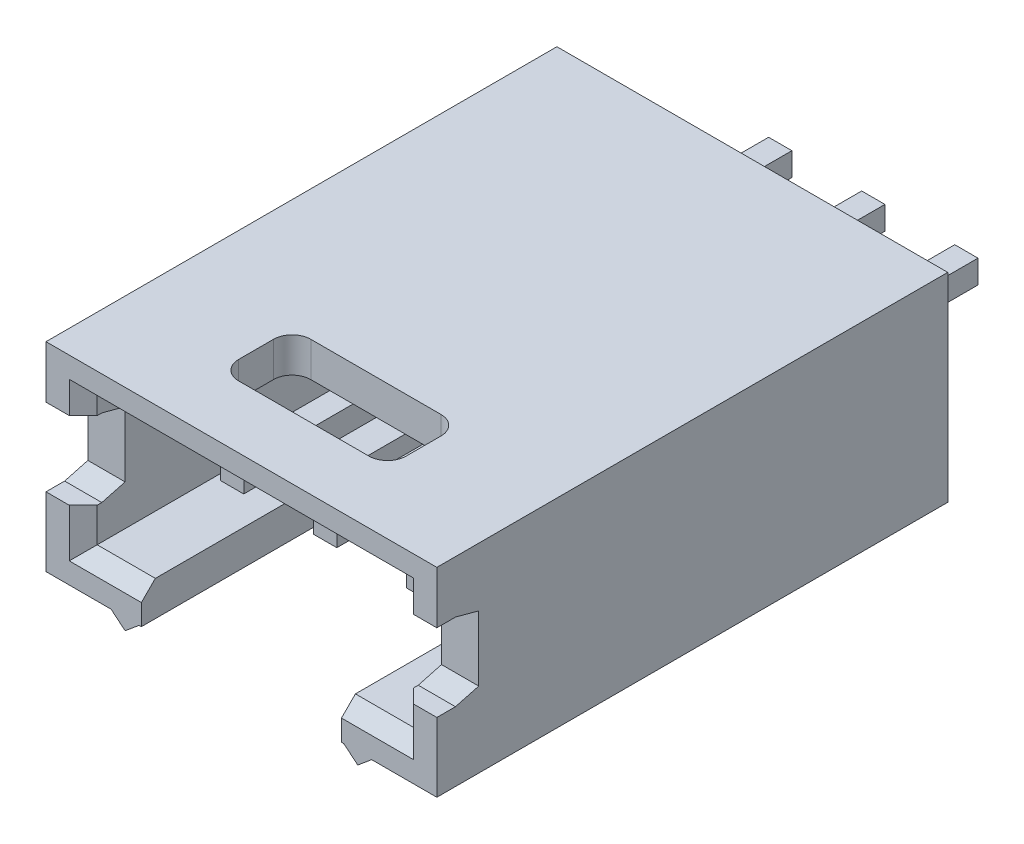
ISO-10303-21;
HEADER;
FILE_DESCRIPTION(('STEP AP214'),'2;1');
FILE_NAME('part.step','',(''),(''),'','','');
FILE_SCHEMA(('AUTOMOTIVE_DESIGN { 1 0 10303 214 1 1 1 1 }'));
ENDSEC;
DATA;
#1=APPLICATION_CONTEXT('core data for automotive mechanical design processes');
#2=APPLICATION_PROTOCOL_DEFINITION('international standard','automotive_design',2000,#1);
#3=PRODUCT_CONTEXT('',#1,'mechanical');
#4=PRODUCT('Part','Part','',(#3));
#5=PRODUCT_RELATED_PRODUCT_CATEGORY('part','',(#4));
#6=PRODUCT_DEFINITION_FORMATION('','',#4);
#7=PRODUCT_DEFINITION_CONTEXT('part definition',#1,'design');
#8=PRODUCT_DEFINITION('design','',#6,#7);
#9=PRODUCT_DEFINITION_SHAPE('','',#8);
#10=(LENGTH_UNIT() NAMED_UNIT(*) SI_UNIT(.MILLI.,.METRE.));
#11=(NAMED_UNIT(*) PLANE_ANGLE_UNIT() SI_UNIT($,.RADIAN.));
#12=(NAMED_UNIT(*) SI_UNIT($,.STERADIAN.) SOLID_ANGLE_UNIT());
#13=UNCERTAINTY_MEASURE_WITH_UNIT(LENGTH_MEASURE(1.E-05),#10,'distance_accuracy_value','');
#14=(GEOMETRIC_REPRESENTATION_CONTEXT(3) GLOBAL_UNCERTAINTY_ASSIGNED_CONTEXT((#13)) GLOBAL_UNIT_ASSIGNED_CONTEXT((#10,
#11,#12)) REPRESENTATION_CONTEXT('',''));
#15=CARTESIAN_POINT('',(0.,0.,0.));
#16=DIRECTION('',(0.,0.,1.));
#17=DIRECTION('',(1.,0.,0.));
#18=AXIS2_PLACEMENT_3D('',#15,#16,#17);
#19=CARTESIAN_POINT('',(-2.286,2.7178,-3.1623));
#20=DIRECTION('',(-1.,0.,0.));
#21=DIRECTION('',(0.,0.,1.));
#22=AXIS2_PLACEMENT_3D('',#19,#20,#21);
#23=PLANE('',#22);
#24=DIRECTION('',(0.,-1.,0.));
#25=VECTOR('',#24,1.);
#26=CARTESIAN_POINT('',(-2.286,2.7178,-2.2098));
#27=LINE('',#26,#25);
#28=CARTESIAN_POINT('',(-2.286,2.7178,-2.2098));
#29=VERTEX_POINT('',#28);
#30=CARTESIAN_POINT('',(-2.286,1.7653,-2.2098));
#31=VERTEX_POINT('',#30);
#32=EDGE_CURVE('E10',#29,#31,#27,.T.);
#33=ORIENTED_EDGE('',*,*,#32,.T.);
#34=DIRECTION('',(0.,0.,1.));
#35=VECTOR('',#34,1.);
#36=CARTESIAN_POINT('',(-2.286,1.7653,-3.1623));
#37=LINE('',#36,#35);
#38=CARTESIAN_POINT('',(-2.286,1.7653,-3.1623));
#39=VERTEX_POINT('',#38);
#40=EDGE_CURVE('E758',#39,#31,#37,.T.);
#41=ORIENTED_EDGE('',*,*,#40,.F.);
#42=DIRECTION('',(0.,-1.,0.));
#43=VECTOR('',#42,1.);
#44=CARTESIAN_POINT('',(-2.286,2.7178,-3.1623));
#45=LINE('',#44,#43);
#46=CARTESIAN_POINT('',(-2.286,2.7178,-3.1623));
#47=VERTEX_POINT('',#46);
#48=EDGE_CURVE('E474',#47,#39,#45,.T.);
#49=ORIENTED_EDGE('',*,*,#48,.F.);
#50=DIRECTION('',(0.,0.,1.));
#51=VECTOR('',#50,1.);
#52=CARTESIAN_POINT('',(-2.286,2.7178,-3.1623));
#53=LINE('',#52,#51);
#54=EDGE_CURVE('E760',#47,#29,#53,.T.);
#55=ORIENTED_EDGE('',*,*,#54,.T.);
#56=EDGE_LOOP('',(#33,#41,#49,#55));
#57=FACE_BOUND('',#56,.T.);
#58=ADVANCED_FACE('F16',(#57),#23,.F.);
#59=CARTESIAN_POINT('',(-1.778,2.7178,-2.2098));
#60=DIRECTION('',(0.,1.,0.));
#61=DIRECTION('',(1.,0.,0.));
#62=AXIS2_PLACEMENT_3D('',#59,#60,#61);
#63=CYLINDRICAL_SURFACE('',#62,0.508);
#64=DIRECTION('',(0.,-1.,0.));
#65=VECTOR('',#64,1.);
#66=CARTESIAN_POINT('',(-1.778,2.7178,-1.7018));
#67=LINE('',#66,#65);
#68=CARTESIAN_POINT('',(-1.778,2.7178,-1.7018));
#69=VERTEX_POINT('',#68);
#70=CARTESIAN_POINT('',(-1.778,1.7653,-1.7018));
#71=VERTEX_POINT('',#70);
#72=EDGE_CURVE('E24',#69,#71,#67,.T.);
#73=ORIENTED_EDGE('',*,*,#72,.T.);
#74=CARTESIAN_POINT('',(-1.778,1.7653,-2.2098));
#75=DIRECTION('',(0.,1.,0.));
#76=DIRECTION('',(-1.,0.,0.));
#77=AXIS2_PLACEMENT_3D('',#74,#75,#76);
#78=CIRCLE('',#77,0.508);
#79=EDGE_CURVE('E763',#31,#71,#78,.T.);
#80=ORIENTED_EDGE('',*,*,#79,.F.);
#81=ORIENTED_EDGE('',*,*,#32,.F.);
#82=CARTESIAN_POINT('',(-1.778,2.7178,-2.2098));
#83=DIRECTION('',(0.,1.,0.));
#84=DIRECTION('',(-1.,0.,0.));
#85=AXIS2_PLACEMENT_3D('',#82,#83,#84);
#86=CIRCLE('',#85,0.508);
#87=EDGE_CURVE('E1134',#29,#69,#86,.T.);
#88=ORIENTED_EDGE('',*,*,#87,.T.);
#89=EDGE_LOOP('',(#73,#80,#81,#88));
#90=FACE_BOUND('',#89,.T.);
#91=ADVANCED_FACE('F748',(#90),#63,.F.);
#92=CARTESIAN_POINT('',(-1.778,2.7178,-1.7018));
#93=DIRECTION('',(0.,0.,1.));
#94=DIRECTION('',(1.,0.,0.));
#95=AXIS2_PLACEMENT_3D('',#92,#93,#94);
#96=PLANE('',#95);
#97=DIRECTION('',(0.,-1.,0.));
#98=VECTOR('',#97,1.);
#99=CARTESIAN_POINT('',(1.778,2.7178,-1.7018));
#100=LINE('',#99,#98);
#101=CARTESIAN_POINT('',(1.778,2.7178,-1.7018));
#102=VERTEX_POINT('',#101);
#103=CARTESIAN_POINT('',(1.778,1.7653,-1.7018));
#104=VERTEX_POINT('',#103);
#105=EDGE_CURVE('E485',#102,#104,#100,.T.);
#106=ORIENTED_EDGE('',*,*,#105,.T.);
#107=DIRECTION('',(1.,0.,0.));
#108=VECTOR('',#107,1.);
#109=CARTESIAN_POINT('',(-1.778,1.7653,-1.7018));
#110=LINE('',#109,#108);
#111=EDGE_CURVE('E767',#71,#104,#110,.T.);
#112=ORIENTED_EDGE('',*,*,#111,.F.);
#113=ORIENTED_EDGE('',*,*,#72,.F.);
#114=DIRECTION('',(1.,0.,0.));
#115=VECTOR('',#114,1.);
#116=CARTESIAN_POINT('',(-1.778,2.7178,-1.7018));
#117=LINE('',#116,#115);
#118=EDGE_CURVE('E1128',#69,#102,#117,.T.);
#119=ORIENTED_EDGE('',*,*,#118,.T.);
#120=EDGE_LOOP('',(#106,#112,#113,#119));
#121=FACE_BOUND('',#120,.T.);
#122=ADVANCED_FACE('F753',(#121),#96,.F.);
#123=CARTESIAN_POINT('',(1.778,2.7178,-2.2098));
#124=DIRECTION('',(0.,1.,0.));
#125=DIRECTION('',(1.,0.,0.));
#126=AXIS2_PLACEMENT_3D('',#123,#124,#125);
#127=CYLINDRICAL_SURFACE('',#126,0.508);
#128=DIRECTION('',(0.,-1.,0.));
#129=VECTOR('',#128,1.);
#130=CARTESIAN_POINT('',(2.286,2.7178,-2.2098));
#131=LINE('',#130,#129);
#132=CARTESIAN_POINT('',(2.286,2.7178,-2.2098));
#133=VERTEX_POINT('',#132);
#134=CARTESIAN_POINT('',(2.286,1.7653,-2.2098));
#135=VERTEX_POINT('',#134);
#136=EDGE_CURVE('E483',#133,#135,#131,.T.);
#137=ORIENTED_EDGE('',*,*,#136,.T.);
#138=CARTESIAN_POINT('',(1.778,1.7653,-2.2098));
#139=DIRECTION('',(0.,1.,0.));
#140=DIRECTION('',(0.,0.,1.));
#141=AXIS2_PLACEMENT_3D('',#138,#139,#140);
#142=CIRCLE('',#141,0.508);
#143=EDGE_CURVE('E1019',#104,#135,#142,.T.);
#144=ORIENTED_EDGE('',*,*,#143,.F.);
#145=ORIENTED_EDGE('',*,*,#105,.F.);
#146=CARTESIAN_POINT('',(1.778,2.7178,-2.2098));
#147=DIRECTION('',(0.,1.,0.));
#148=DIRECTION('',(0.,0.,1.));
#149=AXIS2_PLACEMENT_3D('',#146,#147,#148);
#150=CIRCLE('',#149,0.508);
#151=EDGE_CURVE('E1124',#102,#133,#150,.T.);
#152=ORIENTED_EDGE('',*,*,#151,.T.);
#153=EDGE_LOOP('',(#137,#144,#145,#152));
#154=FACE_BOUND('',#153,.T.);
#155=ADVANCED_FACE('F1731',(#154),#127,.F.);
#156=CARTESIAN_POINT('',(2.286,2.7178,-2.2098));
#157=DIRECTION('',(1.,0.,0.));
#158=DIRECTION('',(0.,1.,0.));
#159=AXIS2_PLACEMENT_3D('',#156,#157,#158);
#160=PLANE('',#159);
#161=DIRECTION('',(0.,-1.,0.));
#162=VECTOR('',#161,1.);
#163=CARTESIAN_POINT('',(2.286,2.7178,-3.1623));
#164=LINE('',#163,#162);
#165=CARTESIAN_POINT('',(2.286,2.7178,-3.1623));
#166=VERTEX_POINT('',#165);
#167=CARTESIAN_POINT('',(2.286,1.7653,-3.1623));
#168=VERTEX_POINT('',#167);
#169=EDGE_CURVE('E482',#166,#168,#164,.T.);
#170=ORIENTED_EDGE('',*,*,#169,.T.);
#171=DIRECTION('',(0.,0.,-1.));
#172=VECTOR('',#171,1.);
#173=CARTESIAN_POINT('',(2.286,1.7653,-2.2098));
#174=LINE('',#173,#172);
#175=EDGE_CURVE('E1023',#135,#168,#174,.T.);
#176=ORIENTED_EDGE('',*,*,#175,.F.);
#177=ORIENTED_EDGE('',*,*,#136,.F.);
#178=DIRECTION('',(0.,0.,-1.));
#179=VECTOR('',#178,1.);
#180=CARTESIAN_POINT('',(2.286,2.7178,-2.2098));
#181=LINE('',#180,#179);
#182=EDGE_CURVE('E985',#133,#166,#181,.T.);
#183=ORIENTED_EDGE('',*,*,#182,.T.);
#184=EDGE_LOOP('',(#170,#176,#177,#183));
#185=FACE_BOUND('',#184,.T.);
#186=ADVANCED_FACE('F1579',(#185),#160,.F.);
#187=CARTESIAN_POINT('',(1.778,2.7178,-3.1623));
#188=DIRECTION('',(0.,1.,0.));
#189=DIRECTION('',(1.,0.,0.));
#190=AXIS2_PLACEMENT_3D('',#187,#188,#189);
#191=CYLINDRICAL_SURFACE('',#190,0.508);
#192=DIRECTION('',(0.,-1.,0.));
#193=VECTOR('',#192,1.);
#194=CARTESIAN_POINT('',(1.778,2.7178,-3.6703));
#195=LINE('',#194,#193);
#196=CARTESIAN_POINT('',(1.778,2.7178,-3.6703));
#197=VERTEX_POINT('',#196);
#198=CARTESIAN_POINT('',(1.778,1.7653,-3.6703));
#199=VERTEX_POINT('',#198);
#200=EDGE_CURVE('E478',#197,#199,#195,.T.);
#201=ORIENTED_EDGE('',*,*,#200,.T.);
#202=CARTESIAN_POINT('',(1.778,1.7653,-3.1623));
#203=DIRECTION('',(0.,1.,0.));
#204=DIRECTION('',(1.,0.,0.));
#205=AXIS2_PLACEMENT_3D('',#202,#203,#204);
#206=CIRCLE('',#205,0.508);
#207=EDGE_CURVE('E994',#168,#199,#206,.T.);
#208=ORIENTED_EDGE('',*,*,#207,.F.);
#209=ORIENTED_EDGE('',*,*,#169,.F.);
#210=CARTESIAN_POINT('',(1.778,2.7178,-3.1623));
#211=DIRECTION('',(0.,1.,0.));
#212=DIRECTION('',(1.,0.,0.));
#213=AXIS2_PLACEMENT_3D('',#210,#211,#212);
#214=CIRCLE('',#213,0.508);
#215=EDGE_CURVE('E981',#166,#197,#214,.T.);
#216=ORIENTED_EDGE('',*,*,#215,.T.);
#217=EDGE_LOOP('',(#201,#208,#209,#216));
#218=FACE_BOUND('',#217,.T.);
#219=ADVANCED_FACE('F1575',(#218),#191,.F.);
#220=CARTESIAN_POINT('',(1.778,2.7178,-3.6703));
#221=DIRECTION('',(0.,0.,-1.));
#222=DIRECTION('',(0.,-1.,0.));
#223=AXIS2_PLACEMENT_3D('',#220,#221,#222);
#224=PLANE('',#223);
#225=DIRECTION('',(0.,-1.,0.));
#226=VECTOR('',#225,1.);
#227=CARTESIAN_POINT('',(-1.778,2.7178,-3.6703));
#228=LINE('',#227,#226);
#229=CARTESIAN_POINT('',(-1.778,2.7178,-3.6703));
#230=VERTEX_POINT('',#229);
#231=CARTESIAN_POINT('',(-1.778,1.7653,-3.6703));
#232=VERTEX_POINT('',#231);
#233=EDGE_CURVE('E475',#230,#232,#228,.T.);
#234=ORIENTED_EDGE('',*,*,#233,.T.);
#235=DIRECTION('',(-1.,0.,0.));
#236=VECTOR('',#235,1.);
#237=CARTESIAN_POINT('',(1.778,1.7653,-3.6703));
#238=LINE('',#237,#236);
#239=EDGE_CURVE('E920',#199,#232,#238,.T.);
#240=ORIENTED_EDGE('',*,*,#239,.F.);
#241=ORIENTED_EDGE('',*,*,#200,.F.);
#242=DIRECTION('',(-1.,0.,0.));
#243=VECTOR('',#242,1.);
#244=CARTESIAN_POINT('',(1.778,2.7178,-3.6703));
#245=LINE('',#244,#243);
#246=EDGE_CURVE('E986',#197,#230,#245,.T.);
#247=ORIENTED_EDGE('',*,*,#246,.T.);
#248=EDGE_LOOP('',(#234,#240,#241,#247));
#249=FACE_BOUND('',#248,.T.);
#250=ADVANCED_FACE('F1578',(#249),#224,.F.);
#251=CARTESIAN_POINT('',(-1.778,2.7178,-3.1623));
#252=DIRECTION('',(0.,1.,0.));
#253=DIRECTION('',(1.,0.,0.));
#254=AXIS2_PLACEMENT_3D('',#251,#252,#253);
#255=CYLINDRICAL_SURFACE('',#254,0.508);
#256=ORIENTED_EDGE('',*,*,#48,.T.);
#257=CARTESIAN_POINT('',(-1.778,1.7653,-3.1623));
#258=DIRECTION('',(0.,1.,0.));
#259=DIRECTION('',(0.,0.,-1.));
#260=AXIS2_PLACEMENT_3D('',#257,#258,#259);
#261=CIRCLE('',#260,0.508);
#262=EDGE_CURVE('E774',#232,#39,#261,.T.);
#263=ORIENTED_EDGE('',*,*,#262,.F.);
#264=ORIENTED_EDGE('',*,*,#233,.F.);
#265=CARTESIAN_POINT('',(-1.778,2.7178,-3.1623));
#266=DIRECTION('',(0.,1.,0.));
#267=DIRECTION('',(0.,0.,-1.));
#268=AXIS2_PLACEMENT_3D('',#265,#266,#267);
#269=CIRCLE('',#268,0.508);
#270=EDGE_CURVE('E1145',#230,#47,#269,.T.);
#271=ORIENTED_EDGE('',*,*,#270,.T.);
#272=EDGE_LOOP('',(#256,#263,#264,#271));
#273=FACE_BOUND('',#272,.T.);
#274=ADVANCED_FACE('F1748',(#273),#255,.F.);
#275=CARTESIAN_POINT('',(4.5085,0.,-0.1905));
#276=DIRECTION('',(-0.707106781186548,0.,0.707106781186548));
#277=DIRECTION('',(0.,1.,0.));
#278=AXIS2_PLACEMENT_3D('',#275,#276,#277);
#279=PLANE('',#278);
#280=DIRECTION('',(0.,-1.,0.));
#281=VECTOR('',#280,1.);
#282=CARTESIAN_POINT('',(4.318,-0.8305477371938,-0.381));
#283=LINE('',#282,#281);
#284=CARTESIAN_POINT('',(4.318,-0.8305477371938,-0.381));
#285=VERTEX_POINT('',#284);
#286=CARTESIAN_POINT('',(4.318,-1.7653,-0.381));
#287=VERTEX_POINT('',#286);
#288=EDGE_CURVE('E839',#285,#287,#283,.T.);
#289=ORIENTED_EDGE('',*,*,#288,.T.);
#290=DIRECTION('',(0.577350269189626,-0.577350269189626,0.577350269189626));
#291=VECTOR('',#290,1.);
#292=CARTESIAN_POINT('',(4.318,-1.7653,-0.381));
#293=LINE('',#292,#291);
#294=CARTESIAN_POINT('',(4.699,-2.1463,0.));
#295=VERTEX_POINT('',#294);
#296=EDGE_CURVE('E978',#287,#295,#293,.T.);
#297=ORIENTED_EDGE('',*,*,#296,.T.);
#298=DIRECTION('',(0.,-1.,0.));
#299=VECTOR('',#298,1.);
#300=CARTESIAN_POINT('',(4.699,-0.8305477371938,0.));
#301=LINE('',#300,#299);
#302=CARTESIAN_POINT('',(4.699,-0.8305477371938,0.));
#303=VERTEX_POINT('',#302);
#304=EDGE_CURVE('E1068',#303,#295,#301,.T.);
#305=ORIENTED_EDGE('',*,*,#304,.F.);
#306=DIRECTION('',(0.707106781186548,0.,0.707106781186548));
#307=VECTOR('',#306,1.);
#308=CARTESIAN_POINT('',(4.318,-0.8305477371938,-0.381));
#309=LINE('',#308,#307);
#310=EDGE_CURVE('E854',#285,#303,#309,.T.);
#311=ORIENTED_EDGE('',*,*,#310,.F.);
#312=EDGE_LOOP('',(#289,#297,#305,#311));
#313=FACE_BOUND('',#312,.T.);
#314=ADVANCED_FACE('F1681',(#313),#279,.T.);
#315=CARTESIAN_POINT('',(4.5085,0.,-0.1905));
#316=DIRECTION('',(-0.707106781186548,0.,0.707106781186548));
#317=DIRECTION('',(0.,1.,0.));
#318=AXIS2_PLACEMENT_3D('',#315,#316,#317);
#319=PLANE('',#318);
#320=DIRECTION('',(0.,-1.,0.));
#321=VECTOR('',#320,1.);
#322=CARTESIAN_POINT('',(4.699,2.1463,0.));
#323=LINE('',#322,#321);
#324=CARTESIAN_POINT('',(4.699,2.1463,0.));
#325=VERTEX_POINT('',#324);
#326=CARTESIAN_POINT('',(4.699,1.287747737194,0.));
#327=VERTEX_POINT('',#326);
#328=EDGE_CURVE('E998',#325,#327,#323,.T.);
#329=ORIENTED_EDGE('',*,*,#328,.F.);
#330=DIRECTION('',(0.577350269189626,0.577350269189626,0.577350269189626));
#331=VECTOR('',#330,1.);
#332=CARTESIAN_POINT('',(4.318,1.7653,-0.381));
#333=LINE('',#332,#331);
#334=CARTESIAN_POINT('',(4.318,1.7653,-0.381));
#335=VERTEX_POINT('',#334);
#336=EDGE_CURVE('E827',#335,#325,#333,.T.);
#337=ORIENTED_EDGE('',*,*,#336,.F.);
#338=DIRECTION('',(0.,-1.,0.));
#339=VECTOR('',#338,1.);
#340=CARTESIAN_POINT('',(4.318,1.7653,-0.381));
#341=LINE('',#340,#339);
#342=CARTESIAN_POINT('',(4.318,1.287747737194,-0.381));
#343=VERTEX_POINT('',#342);
#344=EDGE_CURVE('E919',#335,#343,#341,.T.);
#345=ORIENTED_EDGE('',*,*,#344,.T.);
#346=DIRECTION('',(0.707106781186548,0.,0.707106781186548));
#347=VECTOR('',#346,1.);
#348=CARTESIAN_POINT('',(4.318,1.287747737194,-0.381));
#349=LINE('',#348,#347);
#350=EDGE_CURVE('E964',#343,#327,#349,.T.);
#351=ORIENTED_EDGE('',*,*,#350,.T.);
#352=EDGE_LOOP('',(#329,#337,#345,#351));
#353=FACE_BOUND('',#352,.T.);
#354=ADVANCED_FACE('F1699',(#353),#319,.T.);
#355=CARTESIAN_POINT('',(5.334,0.,0.));
#356=DIRECTION('',(1.,0.,0.));
#357=DIRECTION('',(0.,1.,0.));
#358=AXIS2_PLACEMENT_3D('',#355,#356,#357);
#359=PLANE('',#358);
#360=DIRECTION('',(0.,0.,-1.));
#361=VECTOR('',#360,1.);
#362=CARTESIAN_POINT('',(5.334,-0.8305477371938,0.));
#363=LINE('',#362,#361);
#364=CARTESIAN_POINT('',(5.334,-0.8305477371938,0.));
#365=VERTEX_POINT('',#364);
#366=CARTESIAN_POINT('',(5.334,-0.8305477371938,-0.508));
#367=VERTEX_POINT('',#366);
#368=EDGE_CURVE('E857',#365,#367,#363,.T.);
#369=ORIENTED_EDGE('',*,*,#368,.F.);
#370=DIRECTION('',(0.,-1.,0.));
#371=VECTOR('',#370,1.);
#372=CARTESIAN_POINT('',(5.334,-0.8305477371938,0.));
#373=LINE('',#372,#371);
#374=CARTESIAN_POINT('',(5.334,-2.7178,0.));
#375=VERTEX_POINT('',#374);
#376=EDGE_CURVE('E1060',#365,#375,#373,.T.);
#377=ORIENTED_EDGE('',*,*,#376,.T.);
#378=DIRECTION('',(0.,0.,-1.));
#379=VECTOR('',#378,1.);
#380=CARTESIAN_POINT('',(5.334,-2.7178,0.));
#381=LINE('',#380,#379);
#382=CARTESIAN_POINT('',(5.334,-2.7178,-13.9446));
#383=VERTEX_POINT('',#382);
#384=EDGE_CURVE('E1044',#375,#383,#381,.T.);
#385=ORIENTED_EDGE('',*,*,#384,.T.);
#386=DIRECTION('',(0.,1.,0.));
#387=VECTOR('',#386,1.);
#388=CARTESIAN_POINT('',(5.334,-2.7178,-13.9446));
#389=LINE('',#388,#387);
#390=CARTESIAN_POINT('',(5.334,2.7178,-13.9446));
#391=VERTEX_POINT('',#390);
#392=EDGE_CURVE('E1154',#383,#391,#389,.T.);
#393=ORIENTED_EDGE('',*,*,#392,.T.);
#394=DIRECTION('',(0.,0.,1.));
#395=VECTOR('',#394,1.);
#396=CARTESIAN_POINT('',(5.334,2.7178,-13.9446));
#397=LINE('',#396,#395);
#398=CARTESIAN_POINT('',(5.334,2.7178,0.));
#399=VERTEX_POINT('',#398);
#400=EDGE_CURVE('E1052',#391,#399,#397,.T.);
#401=ORIENTED_EDGE('',*,*,#400,.T.);
#402=DIRECTION('',(0.,-1.,0.));
#403=VECTOR('',#402,1.);
#404=CARTESIAN_POINT('',(5.334,2.7178,0.));
#405=LINE('',#404,#403);
#406=CARTESIAN_POINT('',(5.334,1.287747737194,0.));
#407=VERTEX_POINT('',#406);
#408=EDGE_CURVE('E1008',#399,#407,#405,.T.);
#409=ORIENTED_EDGE('',*,*,#408,.T.);
#410=DIRECTION('',(0.,0.,-1.));
#411=VECTOR('',#410,1.);
#412=CARTESIAN_POINT('',(5.334,1.287747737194,0.));
#413=LINE('',#412,#411);
#414=CARTESIAN_POINT('',(5.334,1.287747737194,-0.508));
#415=VERTEX_POINT('',#414);
#416=EDGE_CURVE('E888',#407,#415,#413,.T.);
#417=ORIENTED_EDGE('',*,*,#416,.T.);
#418=DIRECTION('',(0.,0.258819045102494,0.965925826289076));
#419=VECTOR('',#418,1.);
#420=CARTESIAN_POINT('',(5.334,1.1176,-1.143));
#421=LINE('',#420,#419);
#422=CARTESIAN_POINT('',(5.334,1.1176,-1.143));
#423=VERTEX_POINT('',#422);
#424=EDGE_CURVE('E916',#423,#415,#421,.T.);
#425=ORIENTED_EDGE('',*,*,#424,.F.);
#426=DIRECTION('',(0.,1.,0.));
#427=VECTOR('',#426,1.);
#428=CARTESIAN_POINT('',(5.334,-0.6604,-1.143));
#429=LINE('',#428,#427);
#430=CARTESIAN_POINT('',(5.334,-0.6604,-1.143));
#431=VERTEX_POINT('',#430);
#432=EDGE_CURVE('E925',#431,#423,#429,.T.);
#433=ORIENTED_EDGE('',*,*,#432,.F.);
#434=DIRECTION('',(0.,0.258819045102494,-0.965925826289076));
#435=VECTOR('',#434,1.);
#436=CARTESIAN_POINT('',(5.334,-0.8305477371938,-0.508));
#437=LINE('',#436,#435);
#438=EDGE_CURVE('E906',#367,#431,#437,.T.);
#439=ORIENTED_EDGE('',*,*,#438,.F.);
#440=EDGE_LOOP('',(#369,#377,#385,#393,#401,#409,#417,#425,#433,#439));
#441=FACE_BOUND('',#440,.T.);
#442=ADVANCED_FACE('F1674',(#441),#359,.T.);
#443=CARTESIAN_POINT('',(2.8575,-0.4699,-8.382));
#444=DIRECTION('',(0.,-1.,0.));
#445=DIRECTION('',(0.,0.,-1.));
#446=AXIS2_PLACEMENT_3D('',#443,#444,#445);
#447=PLANE('',#446);
#448=DIRECTION('',(0.,0.,1.));
#449=VECTOR('',#448,1.);
#450=CARTESIAN_POINT('',(2.8575,-0.4699,-8.382));
#451=LINE('',#450,#449);
#452=CARTESIAN_POINT('',(2.8575,-0.4699,-8.382));
#453=VERTEX_POINT('',#452);
#454=CARTESIAN_POINT('',(2.8575,-0.4699,-2.286));
#455=VERTEX_POINT('',#454);
#456=EDGE_CURVE('E449',#453,#455,#451,.T.);
#457=ORIENTED_EDGE('',*,*,#456,.T.);
#458=DIRECTION('',(-1.,0.,0.));
#459=VECTOR('',#458,1.);
#460=CARTESIAN_POINT('',(2.8575,-0.4699,-2.286));
#461=LINE('',#460,#459);
#462=CARTESIAN_POINT('',(2.2225,-0.4699,-2.286));
#463=VERTEX_POINT('',#462);
#464=EDGE_CURVE('E49',#455,#463,#461,.T.);
#465=ORIENTED_EDGE('',*,*,#464,.T.);
#466=DIRECTION('',(0.,0.,1.));
#467=VECTOR('',#466,1.);
#468=CARTESIAN_POINT('',(2.2225,-0.4699,-8.382));
#469=LINE('',#468,#467);
#470=CARTESIAN_POINT('',(2.2225,-0.4699,-8.382));
#471=VERTEX_POINT('',#470);
#472=EDGE_CURVE('E459',#471,#463,#469,.T.);
#473=ORIENTED_EDGE('',*,*,#472,.F.);
#474=DIRECTION('',(-1.,0.,0.));
#475=VECTOR('',#474,1.);
#476=CARTESIAN_POINT('',(2.8575,-0.4699,-8.382));
#477=LINE('',#476,#475);
#478=EDGE_CURVE('E629',#453,#471,#477,.T.);
#479=ORIENTED_EDGE('',*,*,#478,.F.);
#480=EDGE_LOOP('',(#457,#465,#473,#479));
#481=FACE_BOUND('',#480,.T.);
#482=ADVANCED_FACE('F628',(#481),#447,.T.);
#483=CARTESIAN_POINT('',(2.8575,-0.4699,-2.286));
#484=DIRECTION('',(0.,0.,1.));
#485=DIRECTION('',(1.,0.,0.));
#486=AXIS2_PLACEMENT_3D('',#483,#484,#485);
#487=PLANE('',#486);
#488=DIRECTION('',(-1.,0.,0.));
#489=VECTOR('',#488,1.);
#490=CARTESIAN_POINT('',(2.8575,0.1651,-2.286));
#491=LINE('',#490,#489);
#492=CARTESIAN_POINT('',(2.8575,0.1651,-2.286));
#493=VERTEX_POINT('',#492);
#494=CARTESIAN_POINT('',(2.2225,0.1651,-2.286));
#495=VERTEX_POINT('',#494);
#496=EDGE_CURVE('E36',#493,#495,#491,.T.);
#497=ORIENTED_EDGE('',*,*,#496,.T.);
#498=DIRECTION('',(0.,1.,0.));
#499=VECTOR('',#498,1.);
#500=CARTESIAN_POINT('',(2.2225,-0.4699,-2.286));
#501=LINE('',#500,#499);
#502=EDGE_CURVE('E463',#463,#495,#501,.T.);
#503=ORIENTED_EDGE('',*,*,#502,.F.);
#504=ORIENTED_EDGE('',*,*,#464,.F.);
#505=DIRECTION('',(0.,1.,0.));
#506=VECTOR('',#505,1.);
#507=CARTESIAN_POINT('',(2.8575,-0.4699,-2.286));
#508=LINE('',#507,#506);
#509=EDGE_CURVE('E453',#455,#493,#508,.T.);
#510=ORIENTED_EDGE('',*,*,#509,.T.);
#511=EDGE_LOOP('',(#497,#503,#504,#510));
#512=FACE_BOUND('',#511,.T.);
#513=ADVANCED_FACE('F607',(#512),#487,.T.);
#514=CARTESIAN_POINT('',(2.8575,0.1651,-2.286));
#515=DIRECTION('',(0.,1.,0.));
#516=DIRECTION('',(1.,0.,0.));
#517=AXIS2_PLACEMENT_3D('',#514,#515,#516);
#518=PLANE('',#517);
#519=DIRECTION('',(0.,0.,-1.));
#520=VECTOR('',#519,1.);
#521=CARTESIAN_POINT('',(2.2225,0.1651,-2.286));
#522=LINE('',#521,#520);
#523=CARTESIAN_POINT('',(2.2225,0.1651,-8.382));
#524=VERTEX_POINT('',#523);
#525=EDGE_CURVE('E467',#495,#524,#522,.T.);
#526=ORIENTED_EDGE('',*,*,#525,.F.);
#527=ORIENTED_EDGE('',*,*,#496,.F.);
#528=DIRECTION('',(0.,0.,-1.));
#529=VECTOR('',#528,1.);
#530=CARTESIAN_POINT('',(2.8575,0.1651,-2.286));
#531=LINE('',#530,#529);
#532=CARTESIAN_POINT('',(2.8575,0.1651,-8.382));
#533=VERTEX_POINT('',#532);
#534=EDGE_CURVE('E601',#493,#533,#531,.T.);
#535=ORIENTED_EDGE('',*,*,#534,.T.);
#536=DIRECTION('',(-1.,0.,0.));
#537=VECTOR('',#536,1.);
#538=CARTESIAN_POINT('',(2.8575,0.1651,-8.382));
#539=LINE('',#538,#537);
#540=EDGE_CURVE('E617',#533,#524,#539,.T.);
#541=ORIENTED_EDGE('',*,*,#540,.T.);
#542=EDGE_LOOP('',(#526,#527,#535,#541));
#543=FACE_BOUND('',#542,.T.);
#544=ADVANCED_FACE('F616',(#543),#518,.T.);
#545=CARTESIAN_POINT('',(2.8575,0.1651,-17.2466));
#546=DIRECTION('',(0.,0.,-1.));
#547=DIRECTION('',(0.,-1.,0.));
#548=AXIS2_PLACEMENT_3D('',#545,#546,#547);
#549=PLANE('',#548);
#550=DIRECTION('',(-1.,0.,0.));
#551=VECTOR('',#550,1.);
#552=CARTESIAN_POINT('',(2.8575,-0.4699,-17.2466));
#553=LINE('',#552,#551);
#554=CARTESIAN_POINT('',(2.8575,-0.4699,-17.2466));
#555=VERTEX_POINT('',#554);
#556=CARTESIAN_POINT('',(2.2225,-0.4699,-17.2466));
#557=VERTEX_POINT('',#556);
#558=EDGE_CURVE('E429',#555,#557,#553,.T.);
#559=ORIENTED_EDGE('',*,*,#558,.T.);
#560=DIRECTION('',(0.,-1.,0.));
#561=VECTOR('',#560,1.);
#562=CARTESIAN_POINT('',(2.2225,0.1651,-17.2466));
#563=LINE('',#562,#561);
#564=CARTESIAN_POINT('',(2.2225,0.1651,-17.2466));
#565=VERTEX_POINT('',#564);
#566=EDGE_CURVE('E421',#565,#557,#563,.T.);
#567=ORIENTED_EDGE('',*,*,#566,.F.);
#568=DIRECTION('',(-1.,0.,0.));
#569=VECTOR('',#568,1.);
#570=CARTESIAN_POINT('',(2.8575,0.1651,-17.2466));
#571=LINE('',#570,#569);
#572=CARTESIAN_POINT('',(2.8575,0.1651,-17.2466));
#573=VERTEX_POINT('',#572);
#574=EDGE_CURVE('E426',#573,#565,#571,.T.);
#575=ORIENTED_EDGE('',*,*,#574,.F.);
#576=DIRECTION('',(0.,-1.,0.));
#577=VECTOR('',#576,1.);
#578=CARTESIAN_POINT('',(2.8575,0.1651,-17.2466));
#579=LINE('',#578,#577);
#580=EDGE_CURVE('E598',#573,#555,#579,.T.);
#581=ORIENTED_EDGE('',*,*,#580,.T.);
#582=EDGE_LOOP('',(#559,#567,#575,#581));
#583=FACE_BOUND('',#582,.T.);
#584=ADVANCED_FACE('F423',(#583),#549,.T.);
#585=CARTESIAN_POINT('',(2.8575,-0.4699,-17.2466));
#586=DIRECTION('',(0.,-1.,0.));
#587=DIRECTION('',(0.,0.,-1.));
#588=AXIS2_PLACEMENT_3D('',#585,#586,#587);
#589=PLANE('',#588);
#590=DIRECTION('',(0.,0.,1.));
#591=VECTOR('',#590,1.);
#592=CARTESIAN_POINT('',(2.2225,-0.4699,-17.2466));
#593=LINE('',#592,#591);
#594=CARTESIAN_POINT('',(2.2225,-0.4699,-13.9446));
#595=VERTEX_POINT('',#594);
#596=EDGE_CURVE('E433',#557,#595,#593,.T.);
#597=ORIENTED_EDGE('',*,*,#596,.F.);
#598=ORIENTED_EDGE('',*,*,#558,.F.);
#599=DIRECTION('',(0.,0.,1.));
#600=VECTOR('',#599,1.);
#601=CARTESIAN_POINT('',(2.8575,-0.4699,-17.2466));
#602=LINE('',#601,#600);
#603=CARTESIAN_POINT('',(2.8575,-0.4699,-13.9446));
#604=VERTEX_POINT('',#603);
#605=EDGE_CURVE('E597',#555,#604,#602,.T.);
#606=ORIENTED_EDGE('',*,*,#605,.T.);
#607=DIRECTION('',(-1.,0.,0.));
#608=VECTOR('',#607,1.);
#609=CARTESIAN_POINT('',(2.8575,-0.4699,-13.9446));
#610=LINE('',#609,#608);
#611=EDGE_CURVE('E1150',#604,#595,#610,.T.);
#612=ORIENTED_EDGE('',*,*,#611,.T.);
#613=EDGE_LOOP('',(#597,#598,#606,#612));
#614=FACE_BOUND('',#613,.T.);
#615=ADVANCED_FACE('F1446',(#614),#589,.T.);
#616=CARTESIAN_POINT('',(2.2225,-0.1524,0.));
#617=DIRECTION('',(-1.,0.,0.));
#618=DIRECTION('',(0.,0.,1.));
#619=AXIS2_PLACEMENT_3D('',#616,#617,#618);
#620=PLANE('',#619);
#621=ORIENTED_EDGE('',*,*,#472,.T.);
#622=ORIENTED_EDGE('',*,*,#502,.T.);
#623=ORIENTED_EDGE('',*,*,#525,.T.);
#624=DIRECTION('',(0.,-1.,0.));
#625=VECTOR('',#624,1.);
#626=CARTESIAN_POINT('',(2.2225,0.1651,-8.382));
#627=LINE('',#626,#625);
#628=EDGE_CURVE('E625',#524,#471,#627,.T.);
#629=ORIENTED_EDGE('',*,*,#628,.T.);
#630=EDGE_LOOP('',(#621,#622,#623,#629));
#631=FACE_BOUND('',#630,.T.);
#632=ADVANCED_FACE('F624',(#631),#620,.T.);
#633=CARTESIAN_POINT('',(2.2225,-0.1524,0.));
#634=DIRECTION('',(-1.,0.,0.));
#635=DIRECTION('',(0.,0.,1.));
#636=AXIS2_PLACEMENT_3D('',#633,#634,#635);
#637=PLANE('',#636);
#638=DIRECTION('',(0.,0.,-1.));
#639=VECTOR('',#638,1.);
#640=CARTESIAN_POINT('',(2.2225,0.1651,-13.9446));
#641=LINE('',#640,#639);
#642=CARTESIAN_POINT('',(2.2225,0.1651,-13.9446));
#643=VERTEX_POINT('',#642);
#644=EDGE_CURVE('E434',#643,#565,#641,.T.);
#645=ORIENTED_EDGE('',*,*,#644,.T.);
#646=ORIENTED_EDGE('',*,*,#566,.T.);
#647=ORIENTED_EDGE('',*,*,#596,.T.);
#648=DIRECTION('',(0.,-1.,0.));
#649=VECTOR('',#648,1.);
#650=CARTESIAN_POINT('',(2.2225,0.1651,-13.9446));
#651=LINE('',#650,#649);
#652=EDGE_CURVE('E439',#643,#595,#651,.T.);
#653=ORIENTED_EDGE('',*,*,#652,.F.);
#654=EDGE_LOOP('',(#645,#646,#647,#653));
#655=FACE_BOUND('',#654,.T.);
#656=ADVANCED_FACE('F437',(#655),#637,.T.);
#657=CARTESIAN_POINT('',(2.8575,0.1651,-13.9446));
#658=DIRECTION('',(0.,1.,0.));
#659=DIRECTION('',(1.,0.,0.));
#660=AXIS2_PLACEMENT_3D('',#657,#658,#659);
#661=PLANE('',#660);
#662=DIRECTION('',(0.,0.,-1.));
#663=VECTOR('',#662,1.);
#664=CARTESIAN_POINT('',(2.8575,0.1651,-13.9446));
#665=LINE('',#664,#663);
#666=CARTESIAN_POINT('',(2.8575,0.1651,-13.9446));
#667=VERTEX_POINT('',#666);
#668=EDGE_CURVE('E446',#667,#573,#665,.T.);
#669=ORIENTED_EDGE('',*,*,#668,.T.);
#670=ORIENTED_EDGE('',*,*,#574,.T.);
#671=ORIENTED_EDGE('',*,*,#644,.F.);
#672=DIRECTION('',(-1.,0.,0.));
#673=VECTOR('',#672,1.);
#674=CARTESIAN_POINT('',(2.8575,0.1651,-13.9446));
#675=LINE('',#674,#673);
#676=EDGE_CURVE('E1171',#667,#643,#675,.T.);
#677=ORIENTED_EDGE('',*,*,#676,.F.);
#678=EDGE_LOOP('',(#669,#670,#671,#677));
#679=FACE_BOUND('',#678,.T.);
#680=ADVANCED_FACE('F445',(#679),#661,.T.);
#681=CARTESIAN_POINT('',(2.8575,-0.1524,0.));
#682=DIRECTION('',(-1.,0.,0.));
#683=DIRECTION('',(0.,0.,1.));
#684=AXIS2_PLACEMENT_3D('',#681,#682,#683);
#685=PLANE('',#684);
#686=ORIENTED_EDGE('',*,*,#534,.F.);
#687=ORIENTED_EDGE('',*,*,#509,.F.);
#688=ORIENTED_EDGE('',*,*,#456,.F.);
#689=DIRECTION('',(0.,-1.,0.));
#690=VECTOR('',#689,1.);
#691=CARTESIAN_POINT('',(2.8575,0.1651,-8.382));
#692=LINE('',#691,#690);
#693=EDGE_CURVE('E612',#533,#453,#692,.T.);
#694=ORIENTED_EDGE('',*,*,#693,.F.);
#695=EDGE_LOOP('',(#686,#687,#688,#694));
#696=FACE_BOUND('',#695,.T.);
#697=ADVANCED_FACE('F610',(#696),#685,.F.);
#698=CARTESIAN_POINT('',(2.8575,-0.1524,0.));
#699=DIRECTION('',(-1.,0.,0.));
#700=DIRECTION('',(0.,0.,1.));
#701=AXIS2_PLACEMENT_3D('',#698,#699,#700);
#702=PLANE('',#701);
#703=ORIENTED_EDGE('',*,*,#605,.F.);
#704=ORIENTED_EDGE('',*,*,#580,.F.);
#705=ORIENTED_EDGE('',*,*,#668,.F.);
#706=DIRECTION('',(0.,-1.,0.));
#707=VECTOR('',#706,1.);
#708=CARTESIAN_POINT('',(2.8575,0.1651,-13.9446));
#709=LINE('',#708,#707);
#710=EDGE_CURVE('E1146',#667,#604,#709,.T.);
#711=ORIENTED_EDGE('',*,*,#710,.T.);
#712=EDGE_LOOP('',(#703,#704,#705,#711));
#713=FACE_BOUND('',#712,.T.);
#714=ADVANCED_FACE('F736',(#713),#702,.F.);
#715=CARTESIAN_POINT('',(0.3175,-0.4699,-8.382));
#716=DIRECTION('',(0.,-1.,0.));
#717=DIRECTION('',(0.,0.,-1.));
#718=AXIS2_PLACEMENT_3D('',#715,#716,#717);
#719=PLANE('',#718);
#720=DIRECTION('',(0.,0.,1.));
#721=VECTOR('',#720,1.);
#722=CARTESIAN_POINT('',(0.3175,-0.4699,-8.382));
#723=LINE('',#722,#721);
#724=CARTESIAN_POINT('',(0.3175,-0.4699,-8.382));
#725=VERTEX_POINT('',#724);
#726=CARTESIAN_POINT('',(0.3175,-0.4699,-2.286));
#727=VERTEX_POINT('',#726);
#728=EDGE_CURVE('E565',#725,#727,#723,.T.);
#729=ORIENTED_EDGE('',*,*,#728,.T.);
#730=DIRECTION('',(-1.,0.,0.));
#731=VECTOR('',#730,1.);
#732=CARTESIAN_POINT('',(0.3175,-0.4699,-2.286));
#733=LINE('',#732,#731);
#734=CARTESIAN_POINT('',(-0.3175,-0.4699,-2.286));
#735=VERTEX_POINT('',#734);
#736=EDGE_CURVE('E594',#727,#735,#733,.T.);
#737=ORIENTED_EDGE('',*,*,#736,.T.);
#738=DIRECTION('',(0.,0.,1.));
#739=VECTOR('',#738,1.);
#740=CARTESIAN_POINT('',(-0.3175,-0.4699,-8.382));
#741=LINE('',#740,#739);
#742=CARTESIAN_POINT('',(-0.3175,-0.4699,-8.382));
#743=VERTEX_POINT('',#742);
#744=EDGE_CURVE('E576',#743,#735,#741,.T.);
#745=ORIENTED_EDGE('',*,*,#744,.F.);
#746=DIRECTION('',(-1.,0.,0.));
#747=VECTOR('',#746,1.);
#748=CARTESIAN_POINT('',(0.3175,-0.4699,-8.382));
#749=LINE('',#748,#747);
#750=EDGE_CURVE('E687',#725,#743,#749,.T.);
#751=ORIENTED_EDGE('',*,*,#750,.F.);
#752=EDGE_LOOP('',(#729,#737,#745,#751));
#753=FACE_BOUND('',#752,.T.);
#754=ADVANCED_FACE('F734',(#753),#719,.T.);
#755=CARTESIAN_POINT('',(0.3175,-0.4699,-2.286));
#756=DIRECTION('',(0.,0.,1.));
#757=DIRECTION('',(1.,0.,0.));
#758=AXIS2_PLACEMENT_3D('',#755,#756,#757);
#759=PLANE('',#758);
#760=DIRECTION('',(-1.,0.,0.));
#761=VECTOR('',#760,1.);
#762=CARTESIAN_POINT('',(0.3175,0.1651,-2.286));
#763=LINE('',#762,#761);
#764=CARTESIAN_POINT('',(0.3175,0.1651,-2.286));
#765=VERTEX_POINT('',#764);
#766=CARTESIAN_POINT('',(-0.3175,0.1651,-2.286));
#767=VERTEX_POINT('',#766);
#768=EDGE_CURVE('E591',#765,#767,#763,.T.);
#769=ORIENTED_EDGE('',*,*,#768,.T.);
#770=DIRECTION('',(0.,1.,0.));
#771=VECTOR('',#770,1.);
#772=CARTESIAN_POINT('',(-0.3175,-0.4699,-2.286));
#773=LINE('',#772,#771);
#774=EDGE_CURVE('E580',#735,#767,#773,.T.);
#775=ORIENTED_EDGE('',*,*,#774,.F.);
#776=ORIENTED_EDGE('',*,*,#736,.F.);
#777=DIRECTION('',(0.,1.,0.));
#778=VECTOR('',#777,1.);
#779=CARTESIAN_POINT('',(0.3175,-0.4699,-2.286));
#780=LINE('',#779,#778);
#781=EDGE_CURVE('E561',#727,#765,#780,.T.);
#782=ORIENTED_EDGE('',*,*,#781,.T.);
#783=EDGE_LOOP('',(#769,#775,#776,#782));
#784=FACE_BOUND('',#783,.T.);
#785=ADVANCED_FACE('F727',(#784),#759,.T.);
#786=CARTESIAN_POINT('',(0.3175,0.1651,-2.286));
#787=DIRECTION('',(0.,1.,0.));
#788=DIRECTION('',(1.,0.,0.));
#789=AXIS2_PLACEMENT_3D('',#786,#787,#788);
#790=PLANE('',#789);
#791=DIRECTION('',(0.,0.,-1.));
#792=VECTOR('',#791,1.);
#793=CARTESIAN_POINT('',(-0.3175,0.1651,-2.286));
#794=LINE('',#793,#792);
#795=CARTESIAN_POINT('',(-0.3175,0.1651,-8.382));
#796=VERTEX_POINT('',#795);
#797=EDGE_CURVE('E584',#767,#796,#794,.T.);
#798=ORIENTED_EDGE('',*,*,#797,.F.);
#799=ORIENTED_EDGE('',*,*,#768,.F.);
#800=DIRECTION('',(0.,0.,-1.));
#801=VECTOR('',#800,1.);
#802=CARTESIAN_POINT('',(0.3175,0.1651,-2.286));
#803=LINE('',#802,#801);
#804=CARTESIAN_POINT('',(0.3175,0.1651,-8.382));
#805=VERTEX_POINT('',#804);
#806=EDGE_CURVE('E557',#765,#805,#803,.T.);
#807=ORIENTED_EDGE('',*,*,#806,.T.);
#808=DIRECTION('',(-1.,0.,0.));
#809=VECTOR('',#808,1.);
#810=CARTESIAN_POINT('',(0.3175,0.1651,-8.382));
#811=LINE('',#810,#809);
#812=EDGE_CURVE('E640',#805,#796,#811,.T.);
#813=ORIENTED_EDGE('',*,*,#812,.T.);
#814=EDGE_LOOP('',(#798,#799,#807,#813));
#815=FACE_BOUND('',#814,.T.);
#816=ADVANCED_FACE('F716',(#815),#790,.T.);
#817=CARTESIAN_POINT('',(0.3175,0.1651,-17.2466));
#818=DIRECTION('',(0.,0.,-1.));
#819=DIRECTION('',(0.,-1.,0.));
#820=AXIS2_PLACEMENT_3D('',#817,#818,#819);
#821=PLANE('',#820);
#822=DIRECTION('',(-1.,0.,0.));
#823=VECTOR('',#822,1.);
#824=CARTESIAN_POINT('',(0.3175,-0.4699,-17.2466));
#825=LINE('',#824,#823);
#826=CARTESIAN_POINT('',(0.3175,-0.4699,-17.2466));
#827=VERTEX_POINT('',#826);
#828=CARTESIAN_POINT('',(-0.3175,-0.4699,-17.2466));
#829=VERTEX_POINT('',#828);
#830=EDGE_CURVE('E588',#827,#829,#825,.T.);
#831=ORIENTED_EDGE('',*,*,#830,.T.);
#832=DIRECTION('',(0.,-1.,0.));
#833=VECTOR('',#832,1.);
#834=CARTESIAN_POINT('',(-0.3175,0.1651,-17.2466));
#835=LINE('',#834,#833);
#836=CARTESIAN_POINT('',(-0.3175,0.1651,-17.2466));
#837=VERTEX_POINT('',#836);
#838=EDGE_CURVE('E540',#837,#829,#835,.T.);
#839=ORIENTED_EDGE('',*,*,#838,.F.);
#840=DIRECTION('',(-1.,0.,0.));
#841=VECTOR('',#840,1.);
#842=CARTESIAN_POINT('',(0.3175,0.1651,-17.2466));
#843=LINE('',#842,#841);
#844=CARTESIAN_POINT('',(0.3175,0.1651,-17.2466));
#845=VERTEX_POINT('',#844);
#846=EDGE_CURVE('E541',#845,#837,#843,.T.);
#847=ORIENTED_EDGE('',*,*,#846,.F.);
#848=DIRECTION('',(0.,-1.,0.));
#849=VECTOR('',#848,1.);
#850=CARTESIAN_POINT('',(0.3175,0.1651,-17.2466));
#851=LINE('',#850,#849);
#852=EDGE_CURVE('E552',#845,#827,#851,.T.);
#853=ORIENTED_EDGE('',*,*,#852,.T.);
#854=EDGE_LOOP('',(#831,#839,#847,#853));
#855=FACE_BOUND('',#854,.T.);
#856=ADVANCED_FACE('F1520',(#855),#821,.T.);
#857=CARTESIAN_POINT('',(0.3175,-0.4699,-17.2466));
#858=DIRECTION('',(0.,-1.,0.));
#859=DIRECTION('',(0.,0.,-1.));
#860=AXIS2_PLACEMENT_3D('',#857,#858,#859);
#861=PLANE('',#860);
#862=DIRECTION('',(0.,0.,1.));
#863=VECTOR('',#862,1.);
#864=CARTESIAN_POINT('',(-0.3175,-0.4699,-17.2466));
#865=LINE('',#864,#863);
#866=CARTESIAN_POINT('',(-0.3175,-0.4699,-13.9446));
#867=VERTEX_POINT('',#866);
#868=EDGE_CURVE('E575',#829,#867,#865,.T.);
#869=ORIENTED_EDGE('',*,*,#868,.F.);
#870=ORIENTED_EDGE('',*,*,#830,.F.);
#871=DIRECTION('',(0.,0.,1.));
#872=VECTOR('',#871,1.);
#873=CARTESIAN_POINT('',(0.3175,-0.4699,-17.2466));
#874=LINE('',#873,#872);
#875=CARTESIAN_POINT('',(0.3175,-0.4699,-13.9446));
#876=VERTEX_POINT('',#875);
#877=EDGE_CURVE('E549',#827,#876,#874,.T.);
#878=ORIENTED_EDGE('',*,*,#877,.T.);
#879=DIRECTION('',(-1.,0.,0.));
#880=VECTOR('',#879,1.);
#881=CARTESIAN_POINT('',(0.3175,-0.4699,-13.9446));
#882=LINE('',#881,#880);
#883=EDGE_CURVE('E1080',#876,#867,#882,.T.);
#884=ORIENTED_EDGE('',*,*,#883,.T.);
#885=EDGE_LOOP('',(#869,#870,#878,#884));
#886=FACE_BOUND('',#885,.T.);
#887=ADVANCED_FACE('F1517',(#886),#861,.T.);
#888=CARTESIAN_POINT('',(-0.3175,-0.1524,0.));
#889=DIRECTION('',(-1.,0.,0.));
#890=DIRECTION('',(0.,0.,1.));
#891=AXIS2_PLACEMENT_3D('',#888,#889,#890);
#892=PLANE('',#891);
#893=ORIENTED_EDGE('',*,*,#744,.T.);
#894=ORIENTED_EDGE('',*,*,#774,.T.);
#895=ORIENTED_EDGE('',*,*,#797,.T.);
#896=DIRECTION('',(0.,-1.,0.));
#897=VECTOR('',#896,1.);
#898=CARTESIAN_POINT('',(-0.3175,0.1651,-8.382));
#899=LINE('',#898,#897);
#900=EDGE_CURVE('E706',#796,#743,#899,.T.);
#901=ORIENTED_EDGE('',*,*,#900,.T.);
#902=EDGE_LOOP('',(#893,#894,#895,#901));
#903=FACE_BOUND('',#902,.T.);
#904=ADVANCED_FACE('F724',(#903),#892,.T.);
#905=CARTESIAN_POINT('',(-0.3175,-0.1524,0.));
#906=DIRECTION('',(-1.,0.,0.));
#907=DIRECTION('',(0.,0.,1.));
#908=AXIS2_PLACEMENT_3D('',#905,#906,#907);
#909=PLANE('',#908);
#910=DIRECTION('',(0.,0.,-1.));
#911=VECTOR('',#910,1.);
#912=CARTESIAN_POINT('',(-0.3175,0.1651,-13.9446));
#913=LINE('',#912,#911);
#914=CARTESIAN_POINT('',(-0.3175,0.1651,-13.9446));
#915=VERTEX_POINT('',#914);
#916=EDGE_CURVE('E536',#915,#837,#913,.T.);
#917=ORIENTED_EDGE('',*,*,#916,.T.);
#918=ORIENTED_EDGE('',*,*,#838,.T.);
#919=ORIENTED_EDGE('',*,*,#868,.T.);
#920=DIRECTION('',(0.,-1.,0.));
#921=VECTOR('',#920,1.);
#922=CARTESIAN_POINT('',(-0.3175,0.1651,-13.9446));
#923=LINE('',#922,#921);
#924=EDGE_CURVE('E1073',#915,#867,#923,.T.);
#925=ORIENTED_EDGE('',*,*,#924,.F.);
#926=EDGE_LOOP('',(#917,#918,#919,#925));
#927=FACE_BOUND('',#926,.T.);
#928=ADVANCED_FACE('F1542',(#927),#909,.T.);
#929=CARTESIAN_POINT('',(0.3175,0.1651,-13.9446));
#930=DIRECTION('',(0.,1.,0.));
#931=DIRECTION('',(1.,0.,0.));
#932=AXIS2_PLACEMENT_3D('',#929,#930,#931);
#933=PLANE('',#932);
#934=DIRECTION('',(0.,0.,-1.));
#935=VECTOR('',#934,1.);
#936=CARTESIAN_POINT('',(0.3175,0.1651,-13.9446));
#937=LINE('',#936,#935);
#938=CARTESIAN_POINT('',(0.3175,0.1651,-13.9446));
#939=VERTEX_POINT('',#938);
#940=EDGE_CURVE('E553',#939,#845,#937,.T.);
#941=ORIENTED_EDGE('',*,*,#940,.T.);
#942=ORIENTED_EDGE('',*,*,#846,.T.);
#943=ORIENTED_EDGE('',*,*,#916,.F.);
#944=DIRECTION('',(-1.,0.,0.));
#945=VECTOR('',#944,1.);
#946=CARTESIAN_POINT('',(0.3175,0.1651,-13.9446));
#947=LINE('',#946,#945);
#948=EDGE_CURVE('E1069',#939,#915,#947,.T.);
#949=ORIENTED_EDGE('',*,*,#948,.F.);
#950=EDGE_LOOP('',(#941,#942,#943,#949));
#951=FACE_BOUND('',#950,.T.);
#952=ADVANCED_FACE('F1539',(#951),#933,.T.);
#953=CARTESIAN_POINT('',(0.3175,-0.1524,0.));
#954=DIRECTION('',(-1.,0.,0.));
#955=DIRECTION('',(0.,0.,1.));
#956=AXIS2_PLACEMENT_3D('',#953,#954,#955);
#957=PLANE('',#956);
#958=ORIENTED_EDGE('',*,*,#806,.F.);
#959=ORIENTED_EDGE('',*,*,#781,.F.);
#960=ORIENTED_EDGE('',*,*,#728,.F.);
#961=DIRECTION('',(0.,-1.,0.));
#962=VECTOR('',#961,1.);
#963=CARTESIAN_POINT('',(0.3175,0.1651,-8.382));
#964=LINE('',#963,#962);
#965=EDGE_CURVE('E632',#805,#725,#964,.T.);
#966=ORIENTED_EDGE('',*,*,#965,.F.);
#967=EDGE_LOOP('',(#958,#959,#960,#966));
#968=FACE_BOUND('',#967,.T.);
#969=ADVANCED_FACE('F730',(#968),#957,.F.);
#970=CARTESIAN_POINT('',(0.3175,-0.1524,0.));
#971=DIRECTION('',(-1.,0.,0.));
#972=DIRECTION('',(0.,0.,1.));
#973=AXIS2_PLACEMENT_3D('',#970,#971,#972);
#974=PLANE('',#973);
#975=ORIENTED_EDGE('',*,*,#877,.F.);
#976=ORIENTED_EDGE('',*,*,#852,.F.);
#977=ORIENTED_EDGE('',*,*,#940,.F.);
#978=DIRECTION('',(0.,-1.,0.));
#979=VECTOR('',#978,1.);
#980=CARTESIAN_POINT('',(0.3175,0.1651,-13.9446));
#981=LINE('',#980,#979);
#982=EDGE_CURVE('E1084',#939,#876,#981,.T.);
#983=ORIENTED_EDGE('',*,*,#982,.T.);
#984=EDGE_LOOP('',(#975,#976,#977,#983));
#985=FACE_BOUND('',#984,.T.);
#986=ADVANCED_FACE('F1535',(#985),#974,.F.);
#987=CARTESIAN_POINT('',(-2.2225,-0.4699,-8.382));
#988=DIRECTION('',(0.,-1.,0.));
#989=DIRECTION('',(0.,0.,-1.));
#990=AXIS2_PLACEMENT_3D('',#987,#988,#989);
#991=PLANE('',#990);
#992=DIRECTION('',(0.,0.,1.));
#993=VECTOR('',#992,1.);
#994=CARTESIAN_POINT('',(-2.2225,-0.4699,-8.382));
#995=LINE('',#994,#993);
#996=CARTESIAN_POINT('',(-2.2225,-0.4699,-8.382));
#997=VERTEX_POINT('',#996);
#998=CARTESIAN_POINT('',(-2.2225,-0.4699,-2.286));
#999=VERTEX_POINT('',#998);
#1000=EDGE_CURVE('E506',#997,#999,#995,.T.);
#1001=ORIENTED_EDGE('',*,*,#1000,.T.);
#1002=DIRECTION('',(-1.,0.,0.));
#1003=VECTOR('',#1002,1.);
#1004=CARTESIAN_POINT('',(-2.2225,-0.4699,-2.286));
#1005=LINE('',#1004,#1003);
#1006=CARTESIAN_POINT('',(-2.8575,-0.4699,-2.286));
#1007=VERTEX_POINT('',#1006);
#1008=EDGE_CURVE('E548',#999,#1007,#1005,.T.);
#1009=ORIENTED_EDGE('',*,*,#1008,.T.);
#1010=DIRECTION('',(0.,0.,1.));
#1011=VECTOR('',#1010,1.);
#1012=CARTESIAN_POINT('',(-2.8575,-0.4699,-8.382));
#1013=LINE('',#1012,#1011);
#1014=CARTESIAN_POINT('',(-2.8575,-0.4699,-8.382));
#1015=VERTEX_POINT('',#1014);
#1016=EDGE_CURVE('E524',#1015,#1007,#1013,.T.);
#1017=ORIENTED_EDGE('',*,*,#1016,.F.);
#1018=DIRECTION('',(-1.,0.,0.));
#1019=VECTOR('',#1018,1.);
#1020=CARTESIAN_POINT('',(-2.2225,-0.4699,-8.382));
#1021=LINE('',#1020,#1019);
#1022=EDGE_CURVE('E699',#997,#1015,#1021,.T.);
#1023=ORIENTED_EDGE('',*,*,#1022,.F.);
#1024=EDGE_LOOP('',(#1001,#1009,#1017,#1023));
#1025=FACE_BOUND('',#1024,.T.);
#1026=ADVANCED_FACE('F1532',(#1025),#991,.T.);
#1027=CARTESIAN_POINT('',(-2.2225,-0.4699,-2.286));
#1028=DIRECTION('',(0.,0.,1.));
#1029=DIRECTION('',(1.,0.,0.));
#1030=AXIS2_PLACEMENT_3D('',#1027,#1028,#1029);
#1031=PLANE('',#1030);
#1032=DIRECTION('',(-1.,0.,0.));
#1033=VECTOR('',#1032,1.);
#1034=CARTESIAN_POINT('',(-2.2225,0.1651,-2.286));
#1035=LINE('',#1034,#1033);
#1036=CARTESIAN_POINT('',(-2.2225,0.1651,-2.286));
#1037=VERTEX_POINT('',#1036);
#1038=CARTESIAN_POINT('',(-2.8575,0.1651,-2.286));
#1039=VERTEX_POINT('',#1038);
#1040=EDGE_CURVE('E545',#1037,#1039,#1035,.T.);
#1041=ORIENTED_EDGE('',*,*,#1040,.T.);
#1042=DIRECTION('',(0.,1.,0.));
#1043=VECTOR('',#1042,1.);
#1044=CARTESIAN_POINT('',(-2.8575,-0.4699,-2.286));
#1045=LINE('',#1044,#1043);
#1046=EDGE_CURVE('E528',#1007,#1039,#1045,.T.);
#1047=ORIENTED_EDGE('',*,*,#1046,.F.);
#1048=ORIENTED_EDGE('',*,*,#1008,.F.);
#1049=DIRECTION('',(0.,1.,0.));
#1050=VECTOR('',#1049,1.);
#1051=CARTESIAN_POINT('',(-2.2225,-0.4699,-2.286));
#1052=LINE('',#1051,#1050);
#1053=EDGE_CURVE('E504',#999,#1037,#1052,.T.);
#1054=ORIENTED_EDGE('',*,*,#1053,.T.);
#1055=EDGE_LOOP('',(#1041,#1047,#1048,#1054));
#1056=FACE_BOUND('',#1055,.T.);
#1057=ADVANCED_FACE('F675',(#1056),#1031,.T.);
#1058=CARTESIAN_POINT('',(-2.2225,0.1651,-2.286));
#1059=DIRECTION('',(0.,1.,0.));
#1060=DIRECTION('',(1.,0.,0.));
#1061=AXIS2_PLACEMENT_3D('',#1058,#1059,#1060);
#1062=PLANE('',#1061);
#1063=DIRECTION('',(0.,0.,-1.));
#1064=VECTOR('',#1063,1.);
#1065=CARTESIAN_POINT('',(-2.8575,0.1651,-2.286));
#1066=LINE('',#1065,#1064);
#1067=CARTESIAN_POINT('',(-2.8575,0.1651,-8.382));
#1068=VERTEX_POINT('',#1067);
#1069=EDGE_CURVE('E532',#1039,#1068,#1066,.T.);
#1070=ORIENTED_EDGE('',*,*,#1069,.F.);
#1071=ORIENTED_EDGE('',*,*,#1040,.F.);
#1072=DIRECTION('',(0.,0.,-1.));
#1073=VECTOR('',#1072,1.);
#1074=CARTESIAN_POINT('',(-2.2225,0.1651,-2.286));
#1075=LINE('',#1074,#1073);
#1076=CARTESIAN_POINT('',(-2.2225,0.1651,-8.382));
#1077=VERTEX_POINT('',#1076);
#1078=EDGE_CURVE('E664',#1037,#1077,#1075,.T.);
#1079=ORIENTED_EDGE('',*,*,#1078,.T.);
#1080=DIRECTION('',(-1.,0.,0.));
#1081=VECTOR('',#1080,1.);
#1082=CARTESIAN_POINT('',(-2.2225,0.1651,-8.382));
#1083=LINE('',#1082,#1081);
#1084=EDGE_CURVE('E688',#1077,#1068,#1083,.T.);
#1085=ORIENTED_EDGE('',*,*,#1084,.T.);
#1086=EDGE_LOOP('',(#1070,#1071,#1079,#1085));
#1087=FACE_BOUND('',#1086,.T.);
#1088=ADVANCED_FACE('F1528',(#1087),#1062,.T.);
#1089=CARTESIAN_POINT('',(-2.2225,0.1651,-17.2466));
#1090=DIRECTION('',(0.,0.,-1.));
#1091=DIRECTION('',(0.,-1.,0.));
#1092=AXIS2_PLACEMENT_3D('',#1089,#1090,#1091);
#1093=PLANE('',#1092);
#1094=DIRECTION('',(-1.,0.,0.));
#1095=VECTOR('',#1094,1.);
#1096=CARTESIAN_POINT('',(-2.2225,-0.4699,-17.2466));
#1097=LINE('',#1096,#1095);
#1098=CARTESIAN_POINT('',(-2.2225,-0.4699,-17.2466));
#1099=VERTEX_POINT('',#1098);
#1100=CARTESIAN_POINT('',(-2.8575,-0.4699,-17.2466));
#1101=VERTEX_POINT('',#1100);
#1102=EDGE_CURVE('E535',#1099,#1101,#1097,.T.);
#1103=ORIENTED_EDGE('',*,*,#1102,.T.);
#1104=DIRECTION('',(0.,-1.,0.));
#1105=VECTOR('',#1104,1.);
#1106=CARTESIAN_POINT('',(-2.8575,0.1651,-17.2466));
#1107=LINE('',#1106,#1105);
#1108=CARTESIAN_POINT('',(-2.8575,0.1651,-17.2466));
#1109=VERTEX_POINT('',#1108);
#1110=EDGE_CURVE('E517',#1109,#1101,#1107,.T.);
#1111=ORIENTED_EDGE('',*,*,#1110,.F.);
#1112=DIRECTION('',(-1.,0.,0.));
#1113=VECTOR('',#1112,1.);
#1114=CARTESIAN_POINT('',(-2.2225,0.1651,-17.2466));
#1115=LINE('',#1114,#1113);
#1116=CARTESIAN_POINT('',(-2.2225,0.1651,-17.2466));
#1117=VERTEX_POINT('',#1116);
#1118=EDGE_CURVE('E509',#1117,#1109,#1115,.T.);
#1119=ORIENTED_EDGE('',*,*,#1118,.F.);
#1120=DIRECTION('',(0.,-1.,0.));
#1121=VECTOR('',#1120,1.);
#1122=CARTESIAN_POINT('',(-2.2225,0.1651,-17.2466));
#1123=LINE('',#1122,#1121);
#1124=EDGE_CURVE('E657',#1117,#1099,#1123,.T.);
#1125=ORIENTED_EDGE('',*,*,#1124,.T.);
#1126=EDGE_LOOP('',(#1103,#1111,#1119,#1125));
#1127=FACE_BOUND('',#1126,.T.);
#1128=ADVANCED_FACE('F1524',(#1127),#1093,.T.);
#1129=CARTESIAN_POINT('',(-2.2225,-0.4699,-17.2466));
#1130=DIRECTION('',(0.,-1.,0.));
#1131=DIRECTION('',(0.,0.,-1.));
#1132=AXIS2_PLACEMENT_3D('',#1129,#1130,#1131);
#1133=PLANE('',#1132);
#1134=DIRECTION('',(0.,0.,1.));
#1135=VECTOR('',#1134,1.);
#1136=CARTESIAN_POINT('',(-2.8575,-0.4699,-17.2466));
#1137=LINE('',#1136,#1135);
#1138=CARTESIAN_POINT('',(-2.8575,-0.4699,-13.9446));
#1139=VERTEX_POINT('',#1138);
#1140=EDGE_CURVE('E521',#1101,#1139,#1137,.T.);
#1141=ORIENTED_EDGE('',*,*,#1140,.F.);
#1142=ORIENTED_EDGE('',*,*,#1102,.F.);
#1143=DIRECTION('',(0.,0.,1.));
#1144=VECTOR('',#1143,1.);
#1145=CARTESIAN_POINT('',(-2.2225,-0.4699,-17.2466));
#1146=LINE('',#1145,#1144);
#1147=CARTESIAN_POINT('',(-2.2225,-0.4699,-13.9446));
#1148=VERTEX_POINT('',#1147);
#1149=EDGE_CURVE('E654',#1099,#1148,#1146,.T.);
#1150=ORIENTED_EDGE('',*,*,#1149,.T.);
#1151=DIRECTION('',(-1.,0.,0.));
#1152=VECTOR('',#1151,1.);
#1153=CARTESIAN_POINT('',(-2.2225,-0.4699,-13.9446));
#1154=LINE('',#1153,#1152);
#1155=EDGE_CURVE('E999',#1148,#1139,#1154,.T.);
#1156=ORIENTED_EDGE('',*,*,#1155,.T.);
#1157=EDGE_LOOP('',(#1141,#1142,#1150,#1156));
#1158=FACE_BOUND('',#1157,.T.);
#1159=ADVANCED_FACE('F1515',(#1158),#1133,.T.);
#1160=CARTESIAN_POINT('',(-2.8575,-0.1524,0.));
#1161=DIRECTION('',(-1.,0.,0.));
#1162=DIRECTION('',(0.,0.,1.));
#1163=AXIS2_PLACEMENT_3D('',#1160,#1161,#1162);
#1164=PLANE('',#1163);
#1165=ORIENTED_EDGE('',*,*,#1016,.T.);
#1166=ORIENTED_EDGE('',*,*,#1046,.T.);
#1167=ORIENTED_EDGE('',*,*,#1069,.T.);
#1168=DIRECTION('',(0.,-1.,0.));
#1169=VECTOR('',#1168,1.);
#1170=CARTESIAN_POINT('',(-2.8575,0.1651,-8.382));
#1171=LINE('',#1170,#1169);
#1172=EDGE_CURVE('E694',#1068,#1015,#1171,.T.);
#1173=ORIENTED_EDGE('',*,*,#1172,.T.);
#1174=EDGE_LOOP('',(#1165,#1166,#1167,#1173));
#1175=FACE_BOUND('',#1174,.T.);
#1176=ADVANCED_FACE('F1511',(#1175),#1164,.T.);
#1177=CARTESIAN_POINT('',(-2.8575,-0.1524,0.));
#1178=DIRECTION('',(-1.,0.,0.));
#1179=DIRECTION('',(0.,0.,1.));
#1180=AXIS2_PLACEMENT_3D('',#1177,#1178,#1179);
#1181=PLANE('',#1180);
#1182=DIRECTION('',(0.,0.,-1.));
#1183=VECTOR('',#1182,1.);
#1184=CARTESIAN_POINT('',(-2.8575,0.1651,-13.9446));
#1185=LINE('',#1184,#1183);
#1186=CARTESIAN_POINT('',(-2.8575,0.1651,-13.9446));
#1187=VERTEX_POINT('',#1186);
#1188=EDGE_CURVE('E513',#1187,#1109,#1185,.T.);
#1189=ORIENTED_EDGE('',*,*,#1188,.T.);
#1190=ORIENTED_EDGE('',*,*,#1110,.T.);
#1191=ORIENTED_EDGE('',*,*,#1140,.T.);
#1192=DIRECTION('',(0.,-1.,0.));
#1193=VECTOR('',#1192,1.);
#1194=CARTESIAN_POINT('',(-2.8575,0.1651,-13.9446));
#1195=LINE('',#1194,#1193);
#1196=EDGE_CURVE('E1004',#1187,#1139,#1195,.T.);
#1197=ORIENTED_EDGE('',*,*,#1196,.F.);
#1198=EDGE_LOOP('',(#1189,#1190,#1191,#1197));
#1199=FACE_BOUND('',#1198,.T.);
#1200=ADVANCED_FACE('F1462',(#1199),#1181,.T.);
#1201=CARTESIAN_POINT('',(-2.2225,0.1651,-13.9446));
#1202=DIRECTION('',(0.,1.,0.));
#1203=DIRECTION('',(1.,0.,0.));
#1204=AXIS2_PLACEMENT_3D('',#1201,#1202,#1203);
#1205=PLANE('',#1204);
#1206=DIRECTION('',(0.,0.,-1.));
#1207=VECTOR('',#1206,1.);
#1208=CARTESIAN_POINT('',(-2.2225,0.1651,-13.9446));
#1209=LINE('',#1208,#1207);
#1210=CARTESIAN_POINT('',(-2.2225,0.1651,-13.9446));
#1211=VERTEX_POINT('',#1210);
#1212=EDGE_CURVE('E661',#1211,#1117,#1209,.T.);
#1213=ORIENTED_EDGE('',*,*,#1212,.T.);
#1214=ORIENTED_EDGE('',*,*,#1118,.T.);
#1215=ORIENTED_EDGE('',*,*,#1188,.F.);
#1216=DIRECTION('',(-1.,0.,0.));
#1217=VECTOR('',#1216,1.);
#1218=CARTESIAN_POINT('',(-2.2225,0.1651,-13.9446));
#1219=LINE('',#1218,#1217);
#1220=EDGE_CURVE('E1093',#1211,#1187,#1219,.T.);
#1221=ORIENTED_EDGE('',*,*,#1220,.F.);
#1222=EDGE_LOOP('',(#1213,#1214,#1215,#1221));
#1223=FACE_BOUND('',#1222,.T.);
#1224=ADVANCED_FACE('F1459',(#1223),#1205,.T.);
#1225=CARTESIAN_POINT('',(-2.2225,-0.1524,0.));
#1226=DIRECTION('',(-1.,0.,0.));
#1227=DIRECTION('',(0.,0.,1.));
#1228=AXIS2_PLACEMENT_3D('',#1225,#1226,#1227);
#1229=PLANE('',#1228);
#1230=ORIENTED_EDGE('',*,*,#1078,.F.);
#1231=ORIENTED_EDGE('',*,*,#1053,.F.);
#1232=ORIENTED_EDGE('',*,*,#1000,.F.);
#1233=DIRECTION('',(0.,-1.,0.));
#1234=VECTOR('',#1233,1.);
#1235=CARTESIAN_POINT('',(-2.2225,0.1651,-8.382));
#1236=LINE('',#1235,#1234);
#1237=EDGE_CURVE('E681',#1077,#997,#1236,.T.);
#1238=ORIENTED_EDGE('',*,*,#1237,.F.);
#1239=EDGE_LOOP('',(#1230,#1231,#1232,#1238));
#1240=FACE_BOUND('',#1239,.T.);
#1241=ADVANCED_FACE('F679',(#1240),#1229,.F.);
#1242=CARTESIAN_POINT('',(-2.2225,-0.1524,0.));
#1243=DIRECTION('',(-1.,0.,0.));
#1244=DIRECTION('',(0.,0.,1.));
#1245=AXIS2_PLACEMENT_3D('',#1242,#1243,#1244);
#1246=PLANE('',#1245);
#1247=ORIENTED_EDGE('',*,*,#1149,.F.);
#1248=ORIENTED_EDGE('',*,*,#1124,.F.);
#1249=ORIENTED_EDGE('',*,*,#1212,.F.);
#1250=DIRECTION('',(0.,-1.,0.));
#1251=VECTOR('',#1250,1.);
#1252=CARTESIAN_POINT('',(-2.2225,0.1651,-13.9446));
#1253=LINE('',#1252,#1251);
#1254=EDGE_CURVE('E1003',#1211,#1148,#1253,.T.);
#1255=ORIENTED_EDGE('',*,*,#1254,.T.);
#1256=EDGE_LOOP('',(#1247,#1248,#1249,#1255));
#1257=FACE_BOUND('',#1256,.T.);
#1258=ADVANCED_FACE('F1452',(#1257),#1246,.F.);
#1259=CARTESIAN_POINT('',(2.7305,-2.7178,0.));
#1260=DIRECTION('',(1.,0.,0.));
#1261=DIRECTION('',(0.,1.,0.));
#1262=AXIS2_PLACEMENT_3D('',#1259,#1260,#1261);
#1263=PLANE('',#1262);
#1264=DIRECTION('',(0.,-0.707106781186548,0.707106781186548));
#1265=VECTOR('',#1264,1.);
#1266=CARTESIAN_POINT('',(2.7305,-1.7653,-0.381));
#1267=LINE('',#1266,#1265);
#1268=CARTESIAN_POINT('',(2.7305,-1.7653,-0.381));
#1269=VERTEX_POINT('',#1268);
#1270=CARTESIAN_POINT('',(2.7305,-2.1463,0.));
#1271=VERTEX_POINT('',#1270);
#1272=EDGE_CURVE('E810',#1269,#1271,#1267,.T.);
#1273=ORIENTED_EDGE('',*,*,#1272,.F.);
#1274=DIRECTION('',(0.,0.,1.));
#1275=VECTOR('',#1274,1.);
#1276=CARTESIAN_POINT('',(2.7305,-1.7653,-8.382));
#1277=LINE('',#1276,#1275);
#1278=CARTESIAN_POINT('',(2.7305,-1.7653,-8.382));
#1279=VERTEX_POINT('',#1278);
#1280=EDGE_CURVE('E649',#1279,#1269,#1277,.T.);
#1281=ORIENTED_EDGE('',*,*,#1280,.F.);
#1282=DIRECTION('',(0.,1.,0.));
#1283=VECTOR('',#1282,1.);
#1284=CARTESIAN_POINT('',(2.7305,-2.7178,-8.382));
#1285=LINE('',#1284,#1283);
#1286=CARTESIAN_POINT('',(2.7305,-2.7178,-8.382));
#1287=VERTEX_POINT('',#1286);
#1288=EDGE_CURVE('E870',#1287,#1279,#1285,.T.);
#1289=ORIENTED_EDGE('',*,*,#1288,.F.);
#1290=DIRECTION('',(0.,0.,-1.));
#1291=VECTOR('',#1290,1.);
#1292=CARTESIAN_POINT('',(2.7305,-2.7178,0.));
#1293=LINE('',#1292,#1291);
#1294=CARTESIAN_POINT('',(2.7305,-2.7178,0.));
#1295=VERTEX_POINT('',#1294);
#1296=EDGE_CURVE('E972',#1295,#1287,#1293,.T.);
#1297=ORIENTED_EDGE('',*,*,#1296,.F.);
#1298=DIRECTION('',(0.,1.,0.));
#1299=VECTOR('',#1298,1.);
#1300=CARTESIAN_POINT('',(2.7305,-2.7178,0.));
#1301=LINE('',#1300,#1299);
#1302=EDGE_CURVE('E895',#1295,#1271,#1301,.T.);
#1303=ORIENTED_EDGE('',*,*,#1302,.T.);
#1304=EDGE_LOOP('',(#1273,#1281,#1289,#1297,#1303));
#1305=FACE_BOUND('',#1304,.T.);
#1306=ADVANCED_FACE('F1455',(#1305),#1263,.F.);
#1307=CARTESIAN_POINT('',(-4.318,-1.7653,0.));
#1308=DIRECTION('',(0.,-1.,0.));
#1309=DIRECTION('',(0.,0.,-1.));
#1310=AXIS2_PLACEMENT_3D('',#1307,#1308,#1309);
#1311=PLANE('',#1310);
#1312=DIRECTION('',(-1.,0.,0.));
#1313=VECTOR('',#1312,1.);
#1314=CARTESIAN_POINT('',(4.318,-1.7653,-0.381));
#1315=LINE('',#1314,#1313);
#1316=EDGE_CURVE('E814',#287,#1269,#1315,.T.);
#1317=ORIENTED_EDGE('',*,*,#1316,.F.);
#1318=DIRECTION('',(0.,0.,-1.));
#1319=VECTOR('',#1318,1.);
#1320=CARTESIAN_POINT('',(4.318,-1.7653,-0.381));
#1321=LINE('',#1320,#1319);
#1322=CARTESIAN_POINT('',(4.318,-1.7653,-8.382));
#1323=VERTEX_POINT('',#1322);
#1324=EDGE_CURVE('E835',#287,#1323,#1321,.T.);
#1325=ORIENTED_EDGE('',*,*,#1324,.T.);
#1326=DIRECTION('',(1.,0.,0.));
#1327=VECTOR('',#1326,1.);
#1328=CARTESIAN_POINT('',(2.7305,-1.7653,-8.382));
#1329=LINE('',#1328,#1327);
#1330=EDGE_CURVE('E874',#1279,#1323,#1329,.T.);
#1331=ORIENTED_EDGE('',*,*,#1330,.F.);
#1332=ORIENTED_EDGE('',*,*,#1280,.T.);
#1333=EDGE_LOOP('',(#1317,#1325,#1331,#1332));
#1334=FACE_BOUND('',#1333,.T.);
#1335=ADVANCED_FACE('F1469',(#1334),#1311,.F.);
#1336=CARTESIAN_POINT('',(-4.318,-1.7653,0.));
#1337=DIRECTION('',(0.,-1.,0.));
#1338=DIRECTION('',(0.,0.,-1.));
#1339=AXIS2_PLACEMENT_3D('',#1336,#1337,#1338);
#1340=PLANE('',#1339);
#1341=DIRECTION('',(1.,0.,0.));
#1342=VECTOR('',#1341,1.);
#1343=CARTESIAN_POINT('',(-4.318,-1.7653,-8.382));
#1344=LINE('',#1343,#1342);
#1345=CARTESIAN_POINT('',(-4.318,-1.7653,-8.382));
#1346=VERTEX_POINT('',#1345);
#1347=CARTESIAN_POINT('',(-2.7305,-1.7653,-8.382));
#1348=VERTEX_POINT('',#1347);
#1349=EDGE_CURVE('E869',#1346,#1348,#1344,.T.);
#1350=ORIENTED_EDGE('',*,*,#1349,.F.);
#1351=DIRECTION('',(0.,0.,-1.));
#1352=VECTOR('',#1351,1.);
#1353=CARTESIAN_POINT('',(-4.318,-1.7653,-0.381));
#1354=LINE('',#1353,#1352);
#1355=CARTESIAN_POINT('',(-4.318,-1.7653,-0.381));
#1356=VERTEX_POINT('',#1355);
#1357=EDGE_CURVE('E861',#1356,#1346,#1354,.T.);
#1358=ORIENTED_EDGE('',*,*,#1357,.F.);
#1359=DIRECTION('',(-1.,0.,0.));
#1360=VECTOR('',#1359,1.);
#1361=CARTESIAN_POINT('',(-2.7305,-1.7653,-0.381));
#1362=LINE('',#1361,#1360);
#1363=CARTESIAN_POINT('',(-2.7305,-1.7653,-0.381));
#1364=VERTEX_POINT('',#1363);
#1365=EDGE_CURVE('E804',#1364,#1356,#1362,.T.);
#1366=ORIENTED_EDGE('',*,*,#1365,.F.);
#1367=DIRECTION('',(0.,0.,1.));
#1368=VECTOR('',#1367,1.);
#1369=CARTESIAN_POINT('',(-2.7305,-1.7653,-8.382));
#1370=LINE('',#1369,#1368);
#1371=EDGE_CURVE('E803',#1348,#1364,#1370,.T.);
#1372=ORIENTED_EDGE('',*,*,#1371,.F.);
#1373=EDGE_LOOP('',(#1350,#1358,#1366,#1372));
#1374=FACE_BOUND('',#1373,.T.);
#1375=ADVANCED_FACE('F1298',(#1374),#1340,.F.);
#1376=CARTESIAN_POINT('',(-5.334,0.,-8.382));
#1377=DIRECTION('',(0.,0.,1.));
#1378=DIRECTION('',(1.,0.,0.));
#1379=AXIS2_PLACEMENT_3D('',#1376,#1377,#1378);
#1380=PLANE('',#1379);
#1381=ORIENTED_EDGE('',*,*,#478,.T.);
#1382=ORIENTED_EDGE('',*,*,#628,.F.);
#1383=ORIENTED_EDGE('',*,*,#540,.F.);
#1384=ORIENTED_EDGE('',*,*,#693,.T.);
#1385=EDGE_LOOP('',(#1381,#1382,#1383,#1384));
#1386=FACE_BOUND('',#1385,.T.);
#1387=ORIENTED_EDGE('',*,*,#750,.T.);
#1388=ORIENTED_EDGE('',*,*,#900,.F.);
#1389=ORIENTED_EDGE('',*,*,#812,.F.);
#1390=ORIENTED_EDGE('',*,*,#965,.T.);
#1391=EDGE_LOOP('',(#1387,#1388,#1389,#1390));
#1392=FACE_BOUND('',#1391,.T.);
#1393=ORIENTED_EDGE('',*,*,#1022,.T.);
#1394=ORIENTED_EDGE('',*,*,#1172,.F.);
#1395=ORIENTED_EDGE('',*,*,#1084,.F.);
#1396=ORIENTED_EDGE('',*,*,#1237,.T.);
#1397=EDGE_LOOP('',(#1393,#1394,#1395,#1396));
#1398=FACE_BOUND('',#1397,.T.);
#1399=DIRECTION('',(0.,1.,0.));
#1400=VECTOR('',#1399,1.);
#1401=CARTESIAN_POINT('',(4.318,-1.7653,-8.382));
#1402=LINE('',#1401,#1400);
#1403=CARTESIAN_POINT('',(4.318,1.7653,-8.382));
#1404=VERTEX_POINT('',#1403);
#1405=EDGE_CURVE('E840',#1323,#1404,#1402,.T.);
#1406=ORIENTED_EDGE('',*,*,#1405,.T.);
#1407=DIRECTION('',(-1.,0.,0.));
#1408=VECTOR('',#1407,1.);
#1409=CARTESIAN_POINT('',(4.318,1.7653,-8.382));
#1410=LINE('',#1409,#1408);
#1411=CARTESIAN_POINT('',(-4.318,1.7653,-8.382));
#1412=VERTEX_POINT('',#1411);
#1413=EDGE_CURVE('E783',#1404,#1412,#1410,.T.);
#1414=ORIENTED_EDGE('',*,*,#1413,.T.);
#1415=DIRECTION('',(0.,-1.,0.));
#1416=VECTOR('',#1415,1.);
#1417=CARTESIAN_POINT('',(-4.318,1.7653,-8.382));
#1418=LINE('',#1417,#1416);
#1419=EDGE_CURVE('E865',#1412,#1346,#1418,.T.);
#1420=ORIENTED_EDGE('',*,*,#1419,.T.);
#1421=ORIENTED_EDGE('',*,*,#1349,.T.);
#1422=DIRECTION('',(0.,-1.,0.));
#1423=VECTOR('',#1422,1.);
#1424=CARTESIAN_POINT('',(-2.7305,-1.7653,-8.382));
#1425=LINE('',#1424,#1423);
#1426=CARTESIAN_POINT('',(-2.7305,-2.7178,-8.382));
#1427=VERTEX_POINT('',#1426);
#1428=EDGE_CURVE('E800',#1348,#1427,#1425,.T.);
#1429=ORIENTED_EDGE('',*,*,#1428,.T.);
#1430=DIRECTION('',(1.,0.,0.));
#1431=VECTOR('',#1430,1.);
#1432=CARTESIAN_POINT('',(-2.7305,-2.7178,-8.382));
#1433=LINE('',#1432,#1431);
#1434=EDGE_CURVE('E1116',#1427,#1287,#1433,.T.);
#1435=ORIENTED_EDGE('',*,*,#1434,.T.);
#1436=ORIENTED_EDGE('',*,*,#1288,.T.);
#1437=ORIENTED_EDGE('',*,*,#1330,.T.);
#1438=EDGE_LOOP('',(#1406,#1414,#1420,#1421,#1429,#1435,#1436,#1437));
#1439=FACE_BOUND('',#1438,.T.);
#1440=ADVANCED_FACE('F691',(#1386,#1392,#1398,#1439),#1380,.T.);
#1441=CARTESIAN_POINT('',(-4.318,1.7653,0.));
#1442=DIRECTION('',(-1.,0.,0.));
#1443=DIRECTION('',(0.,0.,1.));
#1444=AXIS2_PLACEMENT_3D('',#1441,#1442,#1443);
#1445=PLANE('',#1444);
#1446=DIRECTION('',(0.,0.,-1.));
#1447=VECTOR('',#1446,1.);
#1448=CARTESIAN_POINT('',(-4.318,-0.8305477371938,-0.381));
#1449=LINE('',#1448,#1447);
#1450=CARTESIAN_POINT('',(-4.318,-0.8305477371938,-0.381));
#1451=VERTEX_POINT('',#1450);
#1452=CARTESIAN_POINT('',(-4.318,-0.8305477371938,-0.508));
#1453=VERTEX_POINT('',#1452);
#1454=EDGE_CURVE('E847',#1451,#1453,#1449,.T.);
#1455=ORIENTED_EDGE('',*,*,#1454,.F.);
#1456=DIRECTION('',(0.,1.,0.));
#1457=VECTOR('',#1456,1.);
#1458=CARTESIAN_POINT('',(-4.318,-1.7653,-0.381));
#1459=LINE('',#1458,#1457);
#1460=EDGE_CURVE('E819',#1356,#1451,#1459,.T.);
#1461=ORIENTED_EDGE('',*,*,#1460,.F.);
#1462=ORIENTED_EDGE('',*,*,#1357,.T.);
#1463=ORIENTED_EDGE('',*,*,#1419,.F.);
#1464=DIRECTION('',(0.,0.,-1.));
#1465=VECTOR('',#1464,1.);
#1466=CARTESIAN_POINT('',(-4.318,1.7653,-0.381));
#1467=LINE('',#1466,#1465);
#1468=CARTESIAN_POINT('',(-4.318,1.7653,-0.381));
#1469=VERTEX_POINT('',#1468);
#1470=EDGE_CURVE('E831',#1469,#1412,#1467,.T.);
#1471=ORIENTED_EDGE('',*,*,#1470,.F.);
#1472=DIRECTION('',(0.,1.,0.));
#1473=VECTOR('',#1472,1.);
#1474=CARTESIAN_POINT('',(-4.318,1.287747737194,-0.381));
#1475=LINE('',#1474,#1473);
#1476=CARTESIAN_POINT('',(-4.318,1.287747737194,-0.381));
#1477=VERTEX_POINT('',#1476);
#1478=EDGE_CURVE('E813',#1477,#1469,#1475,.T.);
#1479=ORIENTED_EDGE('',*,*,#1478,.F.);
#1480=DIRECTION('',(0.,0.,-1.));
#1481=VECTOR('',#1480,1.);
#1482=CARTESIAN_POINT('',(-4.318,1.287747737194,-0.381));
#1483=LINE('',#1482,#1481);
#1484=CARTESIAN_POINT('',(-4.318,1.287747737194,-0.508));
#1485=VERTEX_POINT('',#1484);
#1486=EDGE_CURVE('E911',#1477,#1485,#1483,.T.);
#1487=ORIENTED_EDGE('',*,*,#1486,.T.);
#1488=DIRECTION('',(0.,0.258819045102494,0.965925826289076));
#1489=VECTOR('',#1488,1.);
#1490=CARTESIAN_POINT('',(-4.318,1.1176,-1.143));
#1491=LINE('',#1490,#1489);
#1492=CARTESIAN_POINT('',(-4.318,1.1176,-1.143));
#1493=VERTEX_POINT('',#1492);
#1494=EDGE_CURVE('E929',#1493,#1485,#1491,.T.);
#1495=ORIENTED_EDGE('',*,*,#1494,.F.);
#1496=DIRECTION('',(0.,1.,0.));
#1497=VECTOR('',#1496,1.);
#1498=CARTESIAN_POINT('',(-4.318,-0.6604,-1.143));
#1499=LINE('',#1498,#1497);
#1500=CARTESIAN_POINT('',(-4.318,-0.6604,-1.143));
#1501=VERTEX_POINT('',#1500);
#1502=EDGE_CURVE('E901',#1501,#1493,#1499,.T.);
#1503=ORIENTED_EDGE('',*,*,#1502,.F.);
#1504=DIRECTION('',(0.,0.258819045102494,-0.965925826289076));
#1505=VECTOR('',#1504,1.);
#1506=CARTESIAN_POINT('',(-4.318,-0.8305477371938,-0.508));
#1507=LINE('',#1506,#1505);
#1508=EDGE_CURVE('E1250',#1453,#1501,#1507,.T.);
#1509=ORIENTED_EDGE('',*,*,#1508,.F.);
#1510=EDGE_LOOP('',(#1455,#1461,#1462,#1463,#1471,#1479,#1487,#1495,#1503,#1509));
#1511=FACE_BOUND('',#1510,.T.);
#1512=ADVANCED_FACE('F1314',(#1511),#1445,.F.);
#1513=CARTESIAN_POINT('',(5.334,-0.8305477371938,0.));
#1514=DIRECTION('',(0.,-1.,0.));
#1515=DIRECTION('',(0.,0.,-1.));
#1516=AXIS2_PLACEMENT_3D('',#1513,#1514,#1515);
#1517=PLANE('',#1516);
#1518=DIRECTION('',(-1.,0.,0.));
#1519=VECTOR('',#1518,1.);
#1520=CARTESIAN_POINT('',(5.334,-0.8305477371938,-0.508));
#1521=LINE('',#1520,#1519);
#1522=CARTESIAN_POINT('',(4.318,-0.8305477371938,-0.508));
#1523=VERTEX_POINT('',#1522);
#1524=EDGE_CURVE('E1275',#367,#1523,#1521,.T.);
#1525=ORIENTED_EDGE('',*,*,#1524,.T.);
#1526=DIRECTION('',(0.,0.,-1.));
#1527=VECTOR('',#1526,1.);
#1528=CARTESIAN_POINT('',(4.318,-0.8305477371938,-0.381));
#1529=LINE('',#1528,#1527);
#1530=EDGE_CURVE('E843',#285,#1523,#1529,.T.);
#1531=ORIENTED_EDGE('',*,*,#1530,.F.);
#1532=ORIENTED_EDGE('',*,*,#310,.T.);
#1533=DIRECTION('',(1.,0.,0.));
#1534=VECTOR('',#1533,1.);
#1535=CARTESIAN_POINT('',(4.699,-0.8305477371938,0.));
#1536=LINE('',#1535,#1534);
#1537=EDGE_CURVE('E1064',#303,#365,#1536,.T.);
#1538=ORIENTED_EDGE('',*,*,#1537,.T.);
#1539=ORIENTED_EDGE('',*,*,#368,.T.);
#1540=EDGE_LOOP('',(#1525,#1531,#1532,#1538,#1539));
#1541=FACE_BOUND('',#1540,.T.);
#1542=ADVANCED_FACE('F1492',(#1541),#1517,.F.);
#1543=CARTESIAN_POINT('',(5.334,-0.8305477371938,0.));
#1544=DIRECTION('',(0.,-1.,0.));
#1545=DIRECTION('',(0.,0.,-1.));
#1546=AXIS2_PLACEMENT_3D('',#1543,#1544,#1545);
#1547=PLANE('',#1546);
#1548=DIRECTION('',(1.,0.,0.));
#1549=VECTOR('',#1548,1.);
#1550=CARTESIAN_POINT('',(-5.334,-0.8305477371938,0.));
#1551=LINE('',#1550,#1549);
#1552=CARTESIAN_POINT('',(-5.334,-0.8305477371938,0.));
#1553=VERTEX_POINT('',#1552);
#1554=CARTESIAN_POINT('',(-4.699,-0.8305477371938,0.));
#1555=VERTEX_POINT('',#1554);
#1556=EDGE_CURVE('E959',#1553,#1555,#1551,.T.);
#1557=ORIENTED_EDGE('',*,*,#1556,.T.);
#1558=DIRECTION('',(0.707106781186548,0.,-0.707106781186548));
#1559=VECTOR('',#1558,1.);
#1560=CARTESIAN_POINT('',(-4.699,-0.8305477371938,0.));
#1561=LINE('',#1560,#1559);
#1562=EDGE_CURVE('E822',#1555,#1451,#1561,.T.);
#1563=ORIENTED_EDGE('',*,*,#1562,.T.);
#1564=ORIENTED_EDGE('',*,*,#1454,.T.);
#1565=DIRECTION('',(-1.,0.,0.));
#1566=VECTOR('',#1565,1.);
#1567=CARTESIAN_POINT('',(-4.318,-0.8305477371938,-0.508));
#1568=LINE('',#1567,#1566);
#1569=CARTESIAN_POINT('',(-5.334,-0.8305477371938,-0.508));
#1570=VERTEX_POINT('',#1569);
#1571=EDGE_CURVE('E1232',#1453,#1570,#1568,.T.);
#1572=ORIENTED_EDGE('',*,*,#1571,.T.);
#1573=DIRECTION('',(0.,0.,-1.));
#1574=VECTOR('',#1573,1.);
#1575=CARTESIAN_POINT('',(-5.334,-0.8305477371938,0.));
#1576=LINE('',#1575,#1574);
#1577=EDGE_CURVE('E1226',#1553,#1570,#1576,.T.);
#1578=ORIENTED_EDGE('',*,*,#1577,.F.);
#1579=EDGE_LOOP('',(#1557,#1563,#1564,#1572,#1578));
#1580=FACE_BOUND('',#1579,.T.);
#1581=ADVANCED_FACE('F1328',(#1580),#1547,.F.);
#1582=CARTESIAN_POINT('',(4.318,-1.7653,0.));
#1583=DIRECTION('',(1.,0.,0.));
#1584=DIRECTION('',(0.,1.,0.));
#1585=AXIS2_PLACEMENT_3D('',#1582,#1583,#1584);
#1586=PLANE('',#1585);
#1587=DIRECTION('',(0.,1.,0.));
#1588=VECTOR('',#1587,1.);
#1589=CARTESIAN_POINT('',(4.318,-0.6604,-1.143));
#1590=LINE('',#1589,#1588);
#1591=CARTESIAN_POINT('',(4.318,-0.6604,-1.143));
#1592=VERTEX_POINT('',#1591);
#1593=CARTESIAN_POINT('',(4.318,1.1176,-1.143));
#1594=VERTEX_POINT('',#1593);
#1595=EDGE_CURVE('E924',#1592,#1594,#1590,.T.);
#1596=ORIENTED_EDGE('',*,*,#1595,.T.);
#1597=DIRECTION('',(0.,0.258819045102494,0.965925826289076));
#1598=VECTOR('',#1597,1.);
#1599=CARTESIAN_POINT('',(4.318,1.1176,-1.143));
#1600=LINE('',#1599,#1598);
#1601=CARTESIAN_POINT('',(4.318,1.287747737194,-0.508));
#1602=VERTEX_POINT('',#1601);
#1603=EDGE_CURVE('E941',#1594,#1602,#1600,.T.);
#1604=ORIENTED_EDGE('',*,*,#1603,.T.);
#1605=DIRECTION('',(0.,0.,-1.));
#1606=VECTOR('',#1605,1.);
#1607=CARTESIAN_POINT('',(4.318,1.287747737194,-0.381));
#1608=LINE('',#1607,#1606);
#1609=EDGE_CURVE('E967',#343,#1602,#1608,.T.);
#1610=ORIENTED_EDGE('',*,*,#1609,.F.);
#1611=ORIENTED_EDGE('',*,*,#344,.F.);
#1612=DIRECTION('',(0.,0.,-1.));
#1613=VECTOR('',#1612,1.);
#1614=CARTESIAN_POINT('',(4.318,1.7653,-0.381));
#1615=LINE('',#1614,#1613);
#1616=EDGE_CURVE('E776',#335,#1404,#1615,.T.);
#1617=ORIENTED_EDGE('',*,*,#1616,.T.);
#1618=ORIENTED_EDGE('',*,*,#1405,.F.);
#1619=ORIENTED_EDGE('',*,*,#1324,.F.);
#1620=ORIENTED_EDGE('',*,*,#288,.F.);
#1621=ORIENTED_EDGE('',*,*,#1530,.T.);
#1622=DIRECTION('',(0.,0.258819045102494,-0.965925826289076));
#1623=VECTOR('',#1622,1.);
#1624=CARTESIAN_POINT('',(4.318,-0.8305477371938,-0.508));
#1625=LINE('',#1624,#1623);
#1626=EDGE_CURVE('E1268',#1523,#1592,#1625,.T.);
#1627=ORIENTED_EDGE('',*,*,#1626,.T.);
#1628=EDGE_LOOP('',(#1596,#1604,#1610,#1611,#1617,#1618,#1619,#1620,#1621,#1627));
#1629=FACE_BOUND('',#1628,.T.);
#1630=ADVANCED_FACE('F1483',(#1629),#1586,.F.);
#1631=CARTESIAN_POINT('',(4.318,1.7653,0.));
#1632=DIRECTION('',(0.,1.,0.));
#1633=DIRECTION('',(1.,0.,0.));
#1634=AXIS2_PLACEMENT_3D('',#1631,#1632,#1633);
#1635=PLANE('',#1634);
#1636=ORIENTED_EDGE('',*,*,#40,.T.);
#1637=ORIENTED_EDGE('',*,*,#79,.T.);
#1638=ORIENTED_EDGE('',*,*,#111,.T.);
#1639=ORIENTED_EDGE('',*,*,#143,.T.);
#1640=ORIENTED_EDGE('',*,*,#175,.T.);
#1641=ORIENTED_EDGE('',*,*,#207,.T.);
#1642=ORIENTED_EDGE('',*,*,#239,.T.);
#1643=ORIENTED_EDGE('',*,*,#262,.T.);
#1644=EDGE_LOOP('',(#1636,#1637,#1638,#1639,#1640,#1641,#1642,#1643));
#1645=FACE_BOUND('',#1644,.T.);
#1646=ORIENTED_EDGE('',*,*,#1470,.T.);
#1647=ORIENTED_EDGE('',*,*,#1413,.F.);
#1648=ORIENTED_EDGE('',*,*,#1616,.F.);
#1649=DIRECTION('',(1.,0.,0.));
#1650=VECTOR('',#1649,1.);
#1651=CARTESIAN_POINT('',(-4.318,1.7653,-0.381));
#1652=LINE('',#1651,#1650);
#1653=EDGE_CURVE('E830',#1469,#335,#1652,.T.);
#1654=ORIENTED_EDGE('',*,*,#1653,.F.);
#1655=EDGE_LOOP('',(#1646,#1647,#1648,#1654));
#1656=FACE_BOUND('',#1655,.T.);
#1657=ADVANCED_FACE('F770',(#1645,#1656),#1635,.F.);
#1658=CARTESIAN_POINT('',(0.,1.9558,-0.1905));
#1659=DIRECTION('',(0.,-0.707106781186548,0.707106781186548));
#1660=DIRECTION('',(-1.,0.,0.));
#1661=AXIS2_PLACEMENT_3D('',#1658,#1659,#1660);
#1662=PLANE('',#1661);
#1663=ORIENTED_EDGE('',*,*,#336,.T.);
#1664=DIRECTION('',(1.,0.,0.));
#1665=VECTOR('',#1664,1.);
#1666=CARTESIAN_POINT('',(-4.699,2.1463,0.));
#1667=LINE('',#1666,#1665);
#1668=CARTESIAN_POINT('',(-4.699,2.1463,0.));
#1669=VERTEX_POINT('',#1668);
#1670=EDGE_CURVE('E991',#1669,#325,#1667,.T.);
#1671=ORIENTED_EDGE('',*,*,#1670,.F.);
#1672=DIRECTION('',(-0.577350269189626,0.577350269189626,0.577350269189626));
#1673=VECTOR('',#1672,1.);
#1674=CARTESIAN_POINT('',(-4.318,1.7653,-0.381));
#1675=LINE('',#1674,#1673);
#1676=EDGE_CURVE('E818',#1469,#1669,#1675,.T.);
#1677=ORIENTED_EDGE('',*,*,#1676,.F.);
#1678=ORIENTED_EDGE('',*,*,#1653,.T.);
#1679=EDGE_LOOP('',(#1663,#1671,#1677,#1678));
#1680=FACE_BOUND('',#1679,.T.);
#1681=ADVANCED_FACE('F1480',(#1680),#1662,.T.);
#1682=CARTESIAN_POINT('',(-4.5085,0.,-0.1905));
#1683=DIRECTION('',(0.707106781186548,0.,0.707106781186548));
#1684=DIRECTION('',(0.,-1.,0.));
#1685=AXIS2_PLACEMENT_3D('',#1682,#1683,#1684);
#1686=PLANE('',#1685);
#1687=DIRECTION('',(0.,1.,0.));
#1688=VECTOR('',#1687,1.);
#1689=CARTESIAN_POINT('',(-4.699,-2.1463,0.));
#1690=LINE('',#1689,#1688);
#1691=CARTESIAN_POINT('',(-4.699,-2.1463,0.));
#1692=VERTEX_POINT('',#1691);
#1693=EDGE_CURVE('E955',#1692,#1555,#1690,.T.);
#1694=ORIENTED_EDGE('',*,*,#1693,.F.);
#1695=DIRECTION('',(-0.577350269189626,-0.577350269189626,0.577350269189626));
#1696=VECTOR('',#1695,1.);
#1697=CARTESIAN_POINT('',(-4.318,-1.7653,-0.381));
#1698=LINE('',#1697,#1696);
#1699=EDGE_CURVE('E808',#1356,#1692,#1698,.T.);
#1700=ORIENTED_EDGE('',*,*,#1699,.F.);
#1701=ORIENTED_EDGE('',*,*,#1460,.T.);
#1702=ORIENTED_EDGE('',*,*,#1562,.F.);
#1703=EDGE_LOOP('',(#1694,#1700,#1701,#1702));
#1704=FACE_BOUND('',#1703,.T.);
#1705=ADVANCED_FACE('F1317',(#1704),#1686,.T.);
#1706=CARTESIAN_POINT('',(-4.5085,0.,-0.1905));
#1707=DIRECTION('',(0.707106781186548,0.,0.707106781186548));
#1708=DIRECTION('',(0.,-1.,0.));
#1709=AXIS2_PLACEMENT_3D('',#1706,#1707,#1708);
#1710=PLANE('',#1709);
#1711=ORIENTED_EDGE('',*,*,#1478,.T.);
#1712=ORIENTED_EDGE('',*,*,#1676,.T.);
#1713=DIRECTION('',(0.,1.,0.));
#1714=VECTOR('',#1713,1.);
#1715=CARTESIAN_POINT('',(-4.699,1.287747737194,0.));
#1716=LINE('',#1715,#1714);
#1717=CARTESIAN_POINT('',(-4.699,1.287747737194,0.));
#1718=VERTEX_POINT('',#1717);
#1719=EDGE_CURVE('E987',#1718,#1669,#1716,.T.);
#1720=ORIENTED_EDGE('',*,*,#1719,.F.);
#1721=DIRECTION('',(0.707106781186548,0.,-0.707106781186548));
#1722=VECTOR('',#1721,1.);
#1723=CARTESIAN_POINT('',(-4.699,1.287747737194,0.));
#1724=LINE('',#1723,#1722);
#1725=EDGE_CURVE('E915',#1718,#1477,#1724,.T.);
#1726=ORIENTED_EDGE('',*,*,#1725,.T.);
#1727=EDGE_LOOP('',(#1711,#1712,#1720,#1726));
#1728=FACE_BOUND('',#1727,.T.);
#1729=ADVANCED_FACE('F1473',(#1728),#1710,.T.);
#1730=CARTESIAN_POINT('',(0.,-1.9558,-0.1905));
#1731=DIRECTION('',(0.,0.707106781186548,0.707106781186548));
#1732=DIRECTION('',(1.,0.,0.));
#1733=AXIS2_PLACEMENT_3D('',#1730,#1731,#1732);
#1734=PLANE('',#1733);
#1735=DIRECTION('',(-1.,0.,0.));
#1736=VECTOR('',#1735,1.);
#1737=CARTESIAN_POINT('',(4.699,-2.1463,0.));
#1738=LINE('',#1737,#1736);
#1739=EDGE_CURVE('E900',#295,#1271,#1738,.T.);
#1740=ORIENTED_EDGE('',*,*,#1739,.F.);
#1741=ORIENTED_EDGE('',*,*,#296,.F.);
#1742=ORIENTED_EDGE('',*,*,#1316,.T.);
#1743=ORIENTED_EDGE('',*,*,#1272,.T.);
#1744=EDGE_LOOP('',(#1740,#1741,#1742,#1743));
#1745=FACE_BOUND('',#1744,.T.);
#1746=ADVANCED_FACE('F1466',(#1745),#1734,.T.);
#1747=CARTESIAN_POINT('',(0.,-1.9558,-0.1905));
#1748=DIRECTION('',(0.,0.707106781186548,0.707106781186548));
#1749=DIRECTION('',(1.,0.,0.));
#1750=AXIS2_PLACEMENT_3D('',#1747,#1748,#1749);
#1751=PLANE('',#1750);
#1752=ORIENTED_EDGE('',*,*,#1365,.T.);
#1753=ORIENTED_EDGE('',*,*,#1699,.T.);
#1754=DIRECTION('',(-1.,0.,0.));
#1755=VECTOR('',#1754,1.);
#1756=CARTESIAN_POINT('',(-2.7305,-2.1463,0.));
#1757=LINE('',#1756,#1755);
#1758=CARTESIAN_POINT('',(-2.7305,-2.1463,0.));
#1759=VERTEX_POINT('',#1758);
#1760=EDGE_CURVE('E960',#1759,#1692,#1757,.T.);
#1761=ORIENTED_EDGE('',*,*,#1760,.F.);
#1762=DIRECTION('',(0.,-0.707106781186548,0.707106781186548));
#1763=VECTOR('',#1762,1.);
#1764=CARTESIAN_POINT('',(-2.7305,-1.7653,-0.381));
#1765=LINE('',#1764,#1763);
#1766=EDGE_CURVE('E809',#1364,#1759,#1765,.T.);
#1767=ORIENTED_EDGE('',*,*,#1766,.F.);
#1768=EDGE_LOOP('',(#1752,#1753,#1761,#1767));
#1769=FACE_BOUND('',#1768,.T.);
#1770=ADVANCED_FACE('F1301',(#1769),#1751,.T.);
#1771=CARTESIAN_POINT('',(-2.7305,-1.7653,0.));
#1772=DIRECTION('',(-1.,0.,0.));
#1773=DIRECTION('',(0.,0.,1.));
#1774=AXIS2_PLACEMENT_3D('',#1771,#1772,#1773);
#1775=PLANE('',#1774);
#1776=DIRECTION('',(0.,0.,-1.));
#1777=VECTOR('',#1776,1.);
#1778=CARTESIAN_POINT('',(-2.7305,-2.7178,0.));
#1779=LINE('',#1778,#1777);
#1780=CARTESIAN_POINT('',(-2.7305,-2.7178,0.));
#1781=VERTEX_POINT('',#1780);
#1782=EDGE_CURVE('E1120',#1781,#1427,#1779,.T.);
#1783=ORIENTED_EDGE('',*,*,#1782,.T.);
#1784=ORIENTED_EDGE('',*,*,#1428,.F.);
#1785=ORIENTED_EDGE('',*,*,#1371,.T.);
#1786=ORIENTED_EDGE('',*,*,#1766,.T.);
#1787=DIRECTION('',(0.,1.,0.));
#1788=VECTOR('',#1787,1.);
#1789=CARTESIAN_POINT('',(-2.7305,-2.7178,0.));
#1790=LINE('',#1789,#1788);
#1791=EDGE_CURVE('E1016',#1781,#1759,#1790,.T.);
#1792=ORIENTED_EDGE('',*,*,#1791,.F.);
#1793=EDGE_LOOP('',(#1783,#1784,#1785,#1786,#1792));
#1794=FACE_BOUND('',#1793,.T.);
#1795=ADVANCED_FACE('F1293',(#1794),#1775,.F.);
#1796=CARTESIAN_POINT('',(3.175,-3.0353,0.));
#1797=DIRECTION('',(0.64018439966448,-0.768221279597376,0.));
#1798=DIRECTION('',(0.,0.,-1.));
#1799=AXIS2_PLACEMENT_3D('',#1796,#1797,#1798);
#1800=PLANE('',#1799);
#1801=DIRECTION('',(0.768221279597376,0.64018439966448,0.));
#1802=VECTOR('',#1801,1.);
#1803=CARTESIAN_POINT('',(3.175,-3.0353,0.));
#1804=LINE('',#1803,#1802);
#1805=CARTESIAN_POINT('',(3.175,-3.0353,0.));
#1806=VERTEX_POINT('',#1805);
#1807=CARTESIAN_POINT('',(3.556,-2.7178,0.));
#1808=VERTEX_POINT('',#1807);
#1809=EDGE_CURVE('E1101',#1806,#1808,#1804,.T.);
#1810=ORIENTED_EDGE('',*,*,#1809,.F.);
#1811=DIRECTION('',(0.,0.,-1.));
#1812=VECTOR('',#1811,1.);
#1813=CARTESIAN_POINT('',(3.175,-3.0353,0.));
#1814=LINE('',#1813,#1812);
#1815=CARTESIAN_POINT('',(3.175,-3.0353,-11.9126));
#1816=VERTEX_POINT('',#1815);
#1817=EDGE_CURVE('E797',#1806,#1816,#1814,.T.);
#1818=ORIENTED_EDGE('',*,*,#1817,.T.);
#1819=DIRECTION('',(0.768221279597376,0.64018439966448,0.));
#1820=VECTOR('',#1819,1.);
#1821=CARTESIAN_POINT('',(3.175,-3.0353,-11.9126));
#1822=LINE('',#1821,#1820);
#1823=CARTESIAN_POINT('',(3.556,-2.7178,-11.9126));
#1824=VERTEX_POINT('',#1823);
#1825=EDGE_CURVE('E793',#1816,#1824,#1822,.T.);
#1826=ORIENTED_EDGE('',*,*,#1825,.T.);
#1827=DIRECTION('',(0.,0.,-1.));
#1828=VECTOR('',#1827,1.);
#1829=CARTESIAN_POINT('',(3.556,-2.7178,0.));
#1830=LINE('',#1829,#1828);
#1831=EDGE_CURVE('E894',#1808,#1824,#1830,.T.);
#1832=ORIENTED_EDGE('',*,*,#1831,.F.);
#1833=EDGE_LOOP('',(#1810,#1818,#1826,#1832));
#1834=FACE_BOUND('',#1833,.T.);
#1835=ADVANCED_FACE('F1441',(#1834),#1800,.T.);
#1836=CARTESIAN_POINT('',(2.794,-2.7178,0.));
#1837=DIRECTION('',(-0.64018439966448,-0.768221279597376,0.));
#1838=DIRECTION('',(-0.768221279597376,0.64018439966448,0.));
#1839=AXIS2_PLACEMENT_3D('',#1836,#1837,#1838);
#1840=PLANE('',#1839);
#1841=DIRECTION('',(0.768221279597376,-0.64018439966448,0.));
#1842=VECTOR('',#1841,1.);
#1843=CARTESIAN_POINT('',(2.794,-2.7178,-11.9126));
#1844=LINE('',#1843,#1842);
#1845=CARTESIAN_POINT('',(2.794,-2.7178,-11.9126));
#1846=VERTEX_POINT('',#1845);
#1847=EDGE_CURVE('E789',#1846,#1816,#1844,.T.);
#1848=ORIENTED_EDGE('',*,*,#1847,.T.);
#1849=ORIENTED_EDGE('',*,*,#1817,.F.);
#1850=DIRECTION('',(0.768221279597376,-0.64018439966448,0.));
#1851=VECTOR('',#1850,1.);
#1852=CARTESIAN_POINT('',(2.794,-2.7178,0.));
#1853=LINE('',#1852,#1851);
#1854=CARTESIAN_POINT('',(2.794,-2.7178,0.));
#1855=VERTEX_POINT('',#1854);
#1856=EDGE_CURVE('E1088',#1855,#1806,#1853,.T.);
#1857=ORIENTED_EDGE('',*,*,#1856,.F.);
#1858=DIRECTION('',(0.,0.,-1.));
#1859=VECTOR('',#1858,1.);
#1860=CARTESIAN_POINT('',(2.794,-2.7178,0.));
#1861=LINE('',#1860,#1859);
#1862=EDGE_CURVE('E893',#1855,#1846,#1861,.T.);
#1863=ORIENTED_EDGE('',*,*,#1862,.T.);
#1864=EDGE_LOOP('',(#1848,#1849,#1857,#1863));
#1865=FACE_BOUND('',#1864,.T.);
#1866=ADVANCED_FACE('F1433',(#1865),#1840,.T.);
#1867=CARTESIAN_POINT('',(-3.175,-3.0353,0.));
#1868=DIRECTION('',(0.64018439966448,-0.768221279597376,0.));
#1869=DIRECTION('',(0.,0.,-1.));
#1870=AXIS2_PLACEMENT_3D('',#1867,#1868,#1869);
#1871=PLANE('',#1870);
#1872=DIRECTION('',(0.768221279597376,0.64018439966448,0.));
#1873=VECTOR('',#1872,1.);
#1874=CARTESIAN_POINT('',(-3.175,-3.0353,0.));
#1875=LINE('',#1874,#1873);
#1876=CARTESIAN_POINT('',(-3.175,-3.0353,0.));
#1877=VERTEX_POINT('',#1876);
#1878=CARTESIAN_POINT('',(-2.794,-2.7178,0.));
#1879=VERTEX_POINT('',#1878);
#1880=EDGE_CURVE('E1041',#1877,#1879,#1875,.T.);
#1881=ORIENTED_EDGE('',*,*,#1880,.F.);
#1882=DIRECTION('',(0.,0.,-1.));
#1883=VECTOR('',#1882,1.);
#1884=CARTESIAN_POINT('',(-3.175,-3.0353,0.));
#1885=LINE('',#1884,#1883);
#1886=CARTESIAN_POINT('',(-3.175,-3.0353,-11.9126));
#1887=VERTEX_POINT('',#1886);
#1888=EDGE_CURVE('E792',#1877,#1887,#1885,.T.);
#1889=ORIENTED_EDGE('',*,*,#1888,.T.);
#1890=DIRECTION('',(0.768221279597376,0.64018439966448,0.));
#1891=VECTOR('',#1890,1.);
#1892=CARTESIAN_POINT('',(-3.175,-3.0353,-11.9126));
#1893=LINE('',#1892,#1891);
#1894=CARTESIAN_POINT('',(-2.794,-2.7178,-11.9126));
#1895=VERTEX_POINT('',#1894);
#1896=EDGE_CURVE('E1089',#1887,#1895,#1893,.T.);
#1897=ORIENTED_EDGE('',*,*,#1896,.T.);
#1898=DIRECTION('',(0.,0.,-1.));
#1899=VECTOR('',#1898,1.);
#1900=CARTESIAN_POINT('',(-2.794,-2.7178,0.));
#1901=LINE('',#1900,#1899);
#1902=EDGE_CURVE('E1138',#1879,#1895,#1901,.T.);
#1903=ORIENTED_EDGE('',*,*,#1902,.F.);
#1904=EDGE_LOOP('',(#1881,#1889,#1897,#1903));
#1905=FACE_BOUND('',#1904,.T.);
#1906=ADVANCED_FACE('F1431',(#1905),#1871,.T.);
#1907=CARTESIAN_POINT('',(-3.556,-2.7178,0.));
#1908=DIRECTION('',(-0.64018439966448,-0.768221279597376,0.));
#1909=DIRECTION('',(-0.768221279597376,0.64018439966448,0.));
#1910=AXIS2_PLACEMENT_3D('',#1907,#1908,#1909);
#1911=PLANE('',#1910);
#1912=DIRECTION('',(0.768221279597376,-0.64018439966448,0.));
#1913=VECTOR('',#1912,1.);
#1914=CARTESIAN_POINT('',(-3.556,-2.7178,-11.9126));
#1915=LINE('',#1914,#1913);
#1916=CARTESIAN_POINT('',(-3.556,-2.7178,-11.9126));
#1917=VERTEX_POINT('',#1916);
#1918=EDGE_CURVE('E1092',#1917,#1887,#1915,.T.);
#1919=ORIENTED_EDGE('',*,*,#1918,.T.);
#1920=ORIENTED_EDGE('',*,*,#1888,.F.);
#1921=DIRECTION('',(0.768221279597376,-0.64018439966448,0.));
#1922=VECTOR('',#1921,1.);
#1923=CARTESIAN_POINT('',(-3.556,-2.7178,0.));
#1924=LINE('',#1923,#1922);
#1925=CARTESIAN_POINT('',(-3.556,-2.7178,0.));
#1926=VERTEX_POINT('',#1925);
#1927=EDGE_CURVE('E1037',#1926,#1877,#1924,.T.);
#1928=ORIENTED_EDGE('',*,*,#1927,.F.);
#1929=DIRECTION('',(0.,0.,-1.));
#1930=VECTOR('',#1929,1.);
#1931=CARTESIAN_POINT('',(-3.556,-2.7178,0.));
#1932=LINE('',#1931,#1930);
#1933=EDGE_CURVE('E1047',#1926,#1917,#1932,.T.);
#1934=ORIENTED_EDGE('',*,*,#1933,.T.);
#1935=EDGE_LOOP('',(#1919,#1920,#1928,#1934));
#1936=FACE_BOUND('',#1935,.T.);
#1937=ADVANCED_FACE('F1429',(#1936),#1911,.T.);
#1938=CARTESIAN_POINT('',(-5.334,0.,-11.9126));
#1939=DIRECTION('',(0.,0.,1.));
#1940=DIRECTION('',(1.,0.,0.));
#1941=AXIS2_PLACEMENT_3D('',#1938,#1939,#1940);
#1942=PLANE('',#1941);
#1943=ORIENTED_EDGE('',*,*,#1825,.F.);
#1944=ORIENTED_EDGE('',*,*,#1847,.F.);
#1945=DIRECTION('',(1.,0.,0.));
#1946=VECTOR('',#1945,1.);
#1947=CARTESIAN_POINT('',(2.794,-2.7178,-11.9126));
#1948=LINE('',#1947,#1946);
#1949=EDGE_CURVE('E890',#1846,#1824,#1948,.T.);
#1950=ORIENTED_EDGE('',*,*,#1949,.T.);
#1951=EDGE_LOOP('',(#1943,#1944,#1950));
#1952=FACE_BOUND('',#1951,.T.);
#1953=ADVANCED_FACE('F1439',(#1952),#1942,.F.);
#1954=CARTESIAN_POINT('',(-5.334,0.,-11.9126));
#1955=DIRECTION('',(0.,0.,1.));
#1956=DIRECTION('',(1.,0.,0.));
#1957=AXIS2_PLACEMENT_3D('',#1954,#1955,#1956);
#1958=PLANE('',#1957);
#1959=ORIENTED_EDGE('',*,*,#1896,.F.);
#1960=ORIENTED_EDGE('',*,*,#1918,.F.);
#1961=DIRECTION('',(1.,0.,0.));
#1962=VECTOR('',#1961,1.);
#1963=CARTESIAN_POINT('',(-3.556,-2.7178,-11.9126));
#1964=LINE('',#1963,#1962);
#1965=EDGE_CURVE('E787',#1917,#1895,#1964,.T.);
#1966=ORIENTED_EDGE('',*,*,#1965,.T.);
#1967=EDGE_LOOP('',(#1959,#1960,#1966));
#1968=FACE_BOUND('',#1967,.T.);
#1969=ADVANCED_FACE('F1574',(#1968),#1958,.F.);
#1970=CARTESIAN_POINT('',(-5.334,-2.7178,0.));
#1971=DIRECTION('',(0.,-1.,0.));
#1972=DIRECTION('',(0.,0.,-1.));
#1973=AXIS2_PLACEMENT_3D('',#1970,#1971,#1972);
#1974=PLANE('',#1973);
#1975=ORIENTED_EDGE('',*,*,#1933,.F.);
#1976=DIRECTION('',(1.,0.,0.));
#1977=VECTOR('',#1976,1.);
#1978=CARTESIAN_POINT('',(-5.334,-2.7178,0.));
#1979=LINE('',#1978,#1977);
#1980=CARTESIAN_POINT('',(-5.334,-2.7178,0.));
#1981=VERTEX_POINT('',#1980);
#1982=EDGE_CURVE('E1033',#1981,#1926,#1979,.T.);
#1983=ORIENTED_EDGE('',*,*,#1982,.F.);
#1984=DIRECTION('',(0.,0.,-1.));
#1985=VECTOR('',#1984,1.);
#1986=CARTESIAN_POINT('',(-5.334,-2.7178,0.));
#1987=LINE('',#1986,#1985);
#1988=CARTESIAN_POINT('',(-5.334,-2.7178,-13.9446));
#1989=VERTEX_POINT('',#1988);
#1990=EDGE_CURVE('E1227',#1981,#1989,#1987,.T.);
#1991=ORIENTED_EDGE('',*,*,#1990,.T.);
#1992=DIRECTION('',(1.,0.,0.));
#1993=VECTOR('',#1992,1.);
#1994=CARTESIAN_POINT('',(-5.334,-2.7178,-13.9446));
#1995=LINE('',#1994,#1993);
#1996=EDGE_CURVE('E1097',#1989,#383,#1995,.T.);
#1997=ORIENTED_EDGE('',*,*,#1996,.T.);
#1998=ORIENTED_EDGE('',*,*,#384,.F.);
#1999=DIRECTION('',(1.,0.,0.));
#2000=VECTOR('',#1999,1.);
#2001=CARTESIAN_POINT('',(3.556,-2.7178,0.));
#2002=LINE('',#2001,#2000);
#2003=EDGE_CURVE('E1056',#1808,#375,#2002,.T.);
#2004=ORIENTED_EDGE('',*,*,#2003,.F.);
#2005=ORIENTED_EDGE('',*,*,#1831,.T.);
#2006=ORIENTED_EDGE('',*,*,#1949,.F.);
#2007=ORIENTED_EDGE('',*,*,#1862,.F.);
#2008=DIRECTION('',(1.,0.,0.));
#2009=VECTOR('',#2008,1.);
#2010=CARTESIAN_POINT('',(2.7305,-2.7178,0.));
#2011=LINE('',#2010,#2009);
#2012=EDGE_CURVE('E899',#1295,#1855,#2011,.T.);
#2013=ORIENTED_EDGE('',*,*,#2012,.F.);
#2014=ORIENTED_EDGE('',*,*,#1296,.T.);
#2015=ORIENTED_EDGE('',*,*,#1434,.F.);
#2016=ORIENTED_EDGE('',*,*,#1782,.F.);
#2017=DIRECTION('',(1.,0.,0.));
#2018=VECTOR('',#2017,1.);
#2019=CARTESIAN_POINT('',(-2.794,-2.7178,0.));
#2020=LINE('',#2019,#2018);
#2021=EDGE_CURVE('E1051',#1879,#1781,#2020,.T.);
#2022=ORIENTED_EDGE('',*,*,#2021,.F.);
#2023=ORIENTED_EDGE('',*,*,#1902,.T.);
#2024=ORIENTED_EDGE('',*,*,#1965,.F.);
#2025=EDGE_LOOP('',(#1975,#1983,#1991,#1997,#1998,#2004,#2005,#2006,#2007,#2013,#2014,#2015,
#2016,#2022,#2023,#2024));
#2026=FACE_BOUND('',#2025,.T.);
#2027=ADVANCED_FACE('F1309',(#2026),#1974,.T.);
#2028=CARTESIAN_POINT('',(-5.334,-2.7178,-13.9446));
#2029=DIRECTION('',(0.,0.,-1.));
#2030=DIRECTION('',(0.,-1.,0.));
#2031=AXIS2_PLACEMENT_3D('',#2028,#2029,#2030);
#2032=PLANE('',#2031);
#2033=ORIENTED_EDGE('',*,*,#676,.T.);
#2034=ORIENTED_EDGE('',*,*,#652,.T.);
#2035=ORIENTED_EDGE('',*,*,#611,.F.);
#2036=ORIENTED_EDGE('',*,*,#710,.F.);
#2037=EDGE_LOOP('',(#2033,#2034,#2035,#2036));
#2038=FACE_BOUND('',#2037,.T.);
#2039=ORIENTED_EDGE('',*,*,#948,.T.);
#2040=ORIENTED_EDGE('',*,*,#924,.T.);
#2041=ORIENTED_EDGE('',*,*,#883,.F.);
#2042=ORIENTED_EDGE('',*,*,#982,.F.);
#2043=EDGE_LOOP('',(#2039,#2040,#2041,#2042));
#2044=FACE_BOUND('',#2043,.T.);
#2045=ORIENTED_EDGE('',*,*,#1220,.T.);
#2046=ORIENTED_EDGE('',*,*,#1196,.T.);
#2047=ORIENTED_EDGE('',*,*,#1155,.F.);
#2048=ORIENTED_EDGE('',*,*,#1254,.F.);
#2049=EDGE_LOOP('',(#2045,#2046,#2047,#2048));
#2050=FACE_BOUND('',#2049,.T.);
#2051=DIRECTION('',(1.,0.,0.));
#2052=VECTOR('',#2051,1.);
#2053=CARTESIAN_POINT('',(-5.334,2.7178,-13.9446));
#2054=LINE('',#2053,#2052);
#2055=CARTESIAN_POINT('',(-5.334,2.7178,-13.9446));
#2056=VERTEX_POINT('',#2055);
#2057=EDGE_CURVE('E1055',#2056,#391,#2054,.T.);
#2058=ORIENTED_EDGE('',*,*,#2057,.T.);
#2059=ORIENTED_EDGE('',*,*,#392,.F.);
#2060=ORIENTED_EDGE('',*,*,#1996,.F.);
#2061=DIRECTION('',(0.,1.,0.));
#2062=VECTOR('',#2061,1.);
#2063=CARTESIAN_POINT('',(-5.334,-2.7178,-13.9446));
#2064=LINE('',#2063,#2062);
#2065=EDGE_CURVE('E1207',#1989,#2056,#2064,.T.);
#2066=ORIENTED_EDGE('',*,*,#2065,.T.);
#2067=EDGE_LOOP('',(#2058,#2059,#2060,#2066));
#2068=FACE_BOUND('',#2067,.T.);
#2069=ADVANCED_FACE('F1567',(#2038,#2044,#2050,#2068),#2032,.T.);
#2070=CARTESIAN_POINT('',(-5.334,2.7178,-13.9446));
#2071=DIRECTION('',(0.,1.,0.));
#2072=DIRECTION('',(1.,0.,0.));
#2073=AXIS2_PLACEMENT_3D('',#2070,#2071,#2072);
#2074=PLANE('',#2073);
#2075=ORIENTED_EDGE('',*,*,#246,.F.);
#2076=ORIENTED_EDGE('',*,*,#215,.F.);
#2077=ORIENTED_EDGE('',*,*,#182,.F.);
#2078=ORIENTED_EDGE('',*,*,#151,.F.);
#2079=ORIENTED_EDGE('',*,*,#118,.F.);
#2080=ORIENTED_EDGE('',*,*,#87,.F.);
#2081=ORIENTED_EDGE('',*,*,#54,.F.);
#2082=ORIENTED_EDGE('',*,*,#270,.F.);
#2083=EDGE_LOOP('',(#2075,#2076,#2077,#2078,#2079,#2080,#2081,#2082));
#2084=FACE_BOUND('',#2083,.T.);
#2085=DIRECTION('',(1.,0.,0.));
#2086=VECTOR('',#2085,1.);
#2087=CARTESIAN_POINT('',(-5.334,2.7178,0.));
#2088=LINE('',#2087,#2086);
#2089=CARTESIAN_POINT('',(-5.334,2.7178,0.));
#2090=VERTEX_POINT('',#2089);
#2091=EDGE_CURVE('E1012',#2090,#399,#2088,.T.);
#2092=ORIENTED_EDGE('',*,*,#2091,.T.);
#2093=ORIENTED_EDGE('',*,*,#400,.F.);
#2094=ORIENTED_EDGE('',*,*,#2057,.F.);
#2095=DIRECTION('',(0.,0.,1.));
#2096=VECTOR('',#2095,1.);
#2097=CARTESIAN_POINT('',(-5.334,2.7178,-13.9446));
#2098=LINE('',#2097,#2096);
#2099=EDGE_CURVE('E1203',#2056,#2090,#2098,.T.);
#2100=ORIENTED_EDGE('',*,*,#2099,.T.);
#2101=EDGE_LOOP('',(#2092,#2093,#2094,#2100));
#2102=FACE_BOUND('',#2101,.T.);
#2103=ADVANCED_FACE('F1564',(#2084,#2102),#2074,.T.);
#2104=CARTESIAN_POINT('',(-5.334,2.7178,0.));
#2105=DIRECTION('',(0.,0.,1.));
#2106=DIRECTION('',(1.,0.,0.));
#2107=AXIS2_PLACEMENT_3D('',#2104,#2105,#2106);
#2108=PLANE('',#2107);
#2109=ORIENTED_EDGE('',*,*,#376,.F.);
#2110=ORIENTED_EDGE('',*,*,#1537,.F.);
#2111=ORIENTED_EDGE('',*,*,#304,.T.);
#2112=ORIENTED_EDGE('',*,*,#1739,.T.);
#2113=ORIENTED_EDGE('',*,*,#1302,.F.);
#2114=ORIENTED_EDGE('',*,*,#2012,.T.);
#2115=ORIENTED_EDGE('',*,*,#1856,.T.);
#2116=ORIENTED_EDGE('',*,*,#1809,.T.);
#2117=ORIENTED_EDGE('',*,*,#2003,.T.);
#2118=EDGE_LOOP('',(#2109,#2110,#2111,#2112,#2113,#2114,#2115,#2116,#2117));
#2119=FACE_BOUND('',#2118,.T.);
#2120=ADVANCED_FACE('F1559',(#2119),#2108,.T.);
#2121=CARTESIAN_POINT('',(-5.334,2.7178,0.));
#2122=DIRECTION('',(0.,0.,1.));
#2123=DIRECTION('',(1.,0.,0.));
#2124=AXIS2_PLACEMENT_3D('',#2121,#2122,#2123);
#2125=PLANE('',#2124);
#2126=ORIENTED_EDGE('',*,*,#1791,.T.);
#2127=ORIENTED_EDGE('',*,*,#1760,.T.);
#2128=ORIENTED_EDGE('',*,*,#1693,.T.);
#2129=ORIENTED_EDGE('',*,*,#1556,.F.);
#2130=DIRECTION('',(0.,-1.,0.));
#2131=VECTOR('',#2130,1.);
#2132=CARTESIAN_POINT('',(-5.334,-0.8305477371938,0.));
#2133=LINE('',#2132,#2131);
#2134=EDGE_CURVE('E1222',#1553,#1981,#2133,.T.);
#2135=ORIENTED_EDGE('',*,*,#2134,.T.);
#2136=ORIENTED_EDGE('',*,*,#1982,.T.);
#2137=ORIENTED_EDGE('',*,*,#1927,.T.);
#2138=ORIENTED_EDGE('',*,*,#1880,.T.);
#2139=ORIENTED_EDGE('',*,*,#2021,.T.);
#2140=EDGE_LOOP('',(#2126,#2127,#2128,#2129,#2135,#2136,#2137,#2138,#2139));
#2141=FACE_BOUND('',#2140,.T.);
#2142=ADVANCED_FACE('F1305',(#2141),#2125,.T.);
#2143=CARTESIAN_POINT('',(-5.334,2.7178,0.));
#2144=DIRECTION('',(0.,0.,1.));
#2145=DIRECTION('',(1.,0.,0.));
#2146=AXIS2_PLACEMENT_3D('',#2143,#2144,#2145);
#2147=PLANE('',#2146);
#2148=ORIENTED_EDGE('',*,*,#1719,.T.);
#2149=ORIENTED_EDGE('',*,*,#1670,.T.);
#2150=ORIENTED_EDGE('',*,*,#328,.T.);
#2151=DIRECTION('',(1.,0.,0.));
#2152=VECTOR('',#2151,1.);
#2153=CARTESIAN_POINT('',(4.699,1.287747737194,0.));
#2154=LINE('',#2153,#2152);
#2155=EDGE_CURVE('E954',#327,#407,#2154,.T.);
#2156=ORIENTED_EDGE('',*,*,#2155,.T.);
#2157=ORIENTED_EDGE('',*,*,#408,.F.);
#2158=ORIENTED_EDGE('',*,*,#2091,.F.);
#2159=DIRECTION('',(0.,-1.,0.));
#2160=VECTOR('',#2159,1.);
#2161=CARTESIAN_POINT('',(-5.334,2.7178,0.));
#2162=LINE('',#2161,#2160);
#2163=CARTESIAN_POINT('',(-5.334,1.287747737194,0.));
#2164=VERTEX_POINT('',#2163);
#2165=EDGE_CURVE('E1208',#2090,#2164,#2162,.T.);
#2166=ORIENTED_EDGE('',*,*,#2165,.T.);
#2167=DIRECTION('',(1.,0.,0.));
#2168=VECTOR('',#2167,1.);
#2169=CARTESIAN_POINT('',(-5.334,1.287747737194,0.));
#2170=LINE('',#2169,#2168);
#2171=EDGE_CURVE('E948',#2164,#1718,#2170,.T.);
#2172=ORIENTED_EDGE('',*,*,#2171,.T.);
#2173=EDGE_LOOP('',(#2148,#2149,#2150,#2156,#2157,#2158,#2166,#2172));
#2174=FACE_BOUND('',#2173,.T.);
#2175=ADVANCED_FACE('F1563',(#2174),#2147,.T.);
#2176=CARTESIAN_POINT('',(5.334,1.287747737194,-0.508));
#2177=DIRECTION('',(0.,1.,0.));
#2178=DIRECTION('',(1.,0.,0.));
#2179=AXIS2_PLACEMENT_3D('',#2176,#2177,#2178);
#2180=PLANE('',#2179);
#2181=ORIENTED_EDGE('',*,*,#2155,.F.);
#2182=ORIENTED_EDGE('',*,*,#350,.F.);
#2183=ORIENTED_EDGE('',*,*,#1609,.T.);
#2184=DIRECTION('',(-1.,0.,0.));
#2185=VECTOR('',#2184,1.);
#2186=CARTESIAN_POINT('',(5.334,1.287747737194,-0.508));
#2187=LINE('',#2186,#2185);
#2188=EDGE_CURVE('E937',#415,#1602,#2187,.T.);
#2189=ORIENTED_EDGE('',*,*,#2188,.F.);
#2190=ORIENTED_EDGE('',*,*,#416,.F.);
#2191=EDGE_LOOP('',(#2181,#2182,#2183,#2189,#2190));
#2192=FACE_BOUND('',#2191,.T.);
#2193=ADVANCED_FACE('F1696',(#2192),#2180,.F.);
#2194=CARTESIAN_POINT('',(5.334,1.287747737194,-0.508));
#2195=DIRECTION('',(0.,1.,0.));
#2196=DIRECTION('',(1.,0.,0.));
#2197=AXIS2_PLACEMENT_3D('',#2194,#2195,#2196);
#2198=PLANE('',#2197);
#2199=DIRECTION('',(-1.,0.,0.));
#2200=VECTOR('',#2199,1.);
#2201=CARTESIAN_POINT('',(-4.318,1.287747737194,-0.508));
#2202=LINE('',#2201,#2200);
#2203=CARTESIAN_POINT('',(-5.334,1.287747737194,-0.508));
#2204=VERTEX_POINT('',#2203);
#2205=EDGE_CURVE('E933',#1485,#2204,#2202,.T.);
#2206=ORIENTED_EDGE('',*,*,#2205,.F.);
#2207=ORIENTED_EDGE('',*,*,#1486,.F.);
#2208=ORIENTED_EDGE('',*,*,#1725,.F.);
#2209=ORIENTED_EDGE('',*,*,#2171,.F.);
#2210=DIRECTION('',(0.,0.,-1.));
#2211=VECTOR('',#2210,1.);
#2212=CARTESIAN_POINT('',(-5.334,1.287747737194,0.));
#2213=LINE('',#2212,#2211);
#2214=EDGE_CURVE('E1215',#2164,#2204,#2213,.T.);
#2215=ORIENTED_EDGE('',*,*,#2214,.T.);
#2216=EDGE_LOOP('',(#2206,#2207,#2208,#2209,#2215));
#2217=FACE_BOUND('',#2216,.T.);
#2218=ADVANCED_FACE('F1612',(#2217),#2198,.F.);
#2219=CARTESIAN_POINT('',(5.334,1.1176,-1.143));
#2220=DIRECTION('',(0.,0.965925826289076,-0.258819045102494));
#2221=DIRECTION('',(-1.,0.,0.));
#2222=AXIS2_PLACEMENT_3D('',#2219,#2220,#2221);
#2223=PLANE('',#2222);
#2224=ORIENTED_EDGE('',*,*,#2188,.T.);
#2225=ORIENTED_EDGE('',*,*,#1603,.F.);
#2226=DIRECTION('',(-1.,0.,0.));
#2227=VECTOR('',#2226,1.);
#2228=CARTESIAN_POINT('',(5.334,1.1176,-1.143));
#2229=LINE('',#2228,#2227);
#2230=EDGE_CURVE('E910',#423,#1594,#2229,.T.);
#2231=ORIENTED_EDGE('',*,*,#2230,.F.);
#2232=ORIENTED_EDGE('',*,*,#424,.T.);
#2233=EDGE_LOOP('',(#2224,#2225,#2231,#2232));
#2234=FACE_BOUND('',#2233,.T.);
#2235=ADVANCED_FACE('F1693',(#2234),#2223,.F.);
#2236=CARTESIAN_POINT('',(5.334,1.1176,-1.143));
#2237=DIRECTION('',(0.,0.965925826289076,-0.258819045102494));
#2238=DIRECTION('',(-1.,0.,0.));
#2239=AXIS2_PLACEMENT_3D('',#2236,#2237,#2238);
#2240=PLANE('',#2239);
#2241=DIRECTION('',(-1.,0.,0.));
#2242=VECTOR('',#2241,1.);
#2243=CARTESIAN_POINT('',(-4.318,1.1176,-1.143));
#2244=LINE('',#2243,#2242);
#2245=CARTESIAN_POINT('',(-5.334,1.1176,-1.143));
#2246=VERTEX_POINT('',#2245);
#2247=EDGE_CURVE('E905',#1493,#2246,#2244,.T.);
#2248=ORIENTED_EDGE('',*,*,#2247,.F.);
#2249=ORIENTED_EDGE('',*,*,#1494,.T.);
#2250=ORIENTED_EDGE('',*,*,#2205,.T.);
#2251=DIRECTION('',(0.,0.258819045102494,0.965925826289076));
#2252=VECTOR('',#2251,1.);
#2253=CARTESIAN_POINT('',(-5.334,1.1176,-1.143));
#2254=LINE('',#2253,#2252);
#2255=EDGE_CURVE('E1197',#2246,#2204,#2254,.T.);
#2256=ORIENTED_EDGE('',*,*,#2255,.F.);
#2257=EDGE_LOOP('',(#2248,#2249,#2250,#2256));
#2258=FACE_BOUND('',#2257,.T.);
#2259=ADVANCED_FACE('F1619',(#2258),#2240,.F.);
#2260=CARTESIAN_POINT('',(5.334,-0.6604,-1.143));
#2261=DIRECTION('',(0.,0.,-1.));
#2262=DIRECTION('',(0.,-1.,0.));
#2263=AXIS2_PLACEMENT_3D('',#2260,#2261,#2262);
#2264=PLANE('',#2263);
#2265=ORIENTED_EDGE('',*,*,#2230,.T.);
#2266=ORIENTED_EDGE('',*,*,#1595,.F.);
#2267=DIRECTION('',(-1.,0.,0.));
#2268=VECTOR('',#2267,1.);
#2269=CARTESIAN_POINT('',(5.334,-0.6604,-1.143));
#2270=LINE('',#2269,#2268);
#2271=EDGE_CURVE('E1249',#431,#1592,#2270,.T.);
#2272=ORIENTED_EDGE('',*,*,#2271,.F.);
#2273=ORIENTED_EDGE('',*,*,#432,.T.);
#2274=EDGE_LOOP('',(#2265,#2266,#2272,#2273));
#2275=FACE_BOUND('',#2274,.T.);
#2276=ADVANCED_FACE('F1688',(#2275),#2264,.F.);
#2277=CARTESIAN_POINT('',(5.334,-0.6604,-1.143));
#2278=DIRECTION('',(0.,0.,-1.));
#2279=DIRECTION('',(0.,-1.,0.));
#2280=AXIS2_PLACEMENT_3D('',#2277,#2278,#2279);
#2281=PLANE('',#2280);
#2282=DIRECTION('',(-1.,0.,0.));
#2283=VECTOR('',#2282,1.);
#2284=CARTESIAN_POINT('',(-4.318,-0.6604,-1.143));
#2285=LINE('',#2284,#2283);
#2286=CARTESIAN_POINT('',(-5.334,-0.6604,-1.143));
#2287=VERTEX_POINT('',#2286);
#2288=EDGE_CURVE('E1245',#1501,#2287,#2285,.T.);
#2289=ORIENTED_EDGE('',*,*,#2288,.F.);
#2290=ORIENTED_EDGE('',*,*,#1502,.T.);
#2291=ORIENTED_EDGE('',*,*,#2247,.T.);
#2292=DIRECTION('',(0.,1.,0.));
#2293=VECTOR('',#2292,1.);
#2294=CARTESIAN_POINT('',(-5.334,-0.6604,-1.143));
#2295=LINE('',#2294,#2293);
#2296=EDGE_CURVE('E1625',#2287,#2246,#2295,.T.);
#2297=ORIENTED_EDGE('',*,*,#2296,.F.);
#2298=EDGE_LOOP('',(#2289,#2290,#2291,#2297));
#2299=FACE_BOUND('',#2298,.T.);
#2300=ADVANCED_FACE('F1623',(#2299),#2281,.F.);
#2301=CARTESIAN_POINT('',(5.334,-0.8305477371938,-0.508));
#2302=DIRECTION('',(0.,-0.965925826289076,-0.258819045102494));
#2303=DIRECTION('',(0.,0.258819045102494,-0.965925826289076));
#2304=AXIS2_PLACEMENT_3D('',#2301,#2302,#2303);
#2305=PLANE('',#2304);
#2306=ORIENTED_EDGE('',*,*,#2271,.T.);
#2307=ORIENTED_EDGE('',*,*,#1626,.F.);
#2308=ORIENTED_EDGE('',*,*,#1524,.F.);
#2309=ORIENTED_EDGE('',*,*,#438,.T.);
#2310=EDGE_LOOP('',(#2306,#2307,#2308,#2309));
#2311=FACE_BOUND('',#2310,.T.);
#2312=ADVANCED_FACE('F1685',(#2311),#2305,.F.);
#2313=CARTESIAN_POINT('',(5.334,-0.8305477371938,-0.508));
#2314=DIRECTION('',(0.,-0.965925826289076,-0.258819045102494));
#2315=DIRECTION('',(0.,0.258819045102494,-0.965925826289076));
#2316=AXIS2_PLACEMENT_3D('',#2313,#2314,#2315);
#2317=PLANE('',#2316);
#2318=ORIENTED_EDGE('',*,*,#1571,.F.);
#2319=ORIENTED_EDGE('',*,*,#1508,.T.);
#2320=ORIENTED_EDGE('',*,*,#2288,.T.);
#2321=DIRECTION('',(0.,0.258819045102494,-0.965925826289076));
#2322=VECTOR('',#2321,1.);
#2323=CARTESIAN_POINT('',(-5.334,-0.8305477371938,-0.508));
#2324=LINE('',#2323,#2322);
#2325=EDGE_CURVE('E1228',#1570,#2287,#2324,.T.);
#2326=ORIENTED_EDGE('',*,*,#2325,.F.);
#2327=EDGE_LOOP('',(#2318,#2319,#2320,#2326));
#2328=FACE_BOUND('',#2327,.T.);
#2329=ADVANCED_FACE('F1627',(#2328),#2317,.F.);
#2330=CARTESIAN_POINT('',(-5.334,0.,0.));
#2331=DIRECTION('',(1.,0.,0.));
#2332=DIRECTION('',(0.,1.,0.));
#2333=AXIS2_PLACEMENT_3D('',#2330,#2331,#2332);
#2334=PLANE('',#2333);
#2335=ORIENTED_EDGE('',*,*,#2296,.T.);
#2336=ORIENTED_EDGE('',*,*,#2255,.T.);
#2337=ORIENTED_EDGE('',*,*,#2214,.F.);
#2338=ORIENTED_EDGE('',*,*,#2165,.F.);
#2339=ORIENTED_EDGE('',*,*,#2099,.F.);
#2340=ORIENTED_EDGE('',*,*,#2065,.F.);
#2341=ORIENTED_EDGE('',*,*,#1990,.F.);
#2342=ORIENTED_EDGE('',*,*,#2134,.F.);
#2343=ORIENTED_EDGE('',*,*,#1577,.T.);
#2344=ORIENTED_EDGE('',*,*,#2325,.T.);
#2345=EDGE_LOOP('',(#2335,#2336,#2337,#2338,#2339,#2340,#2341,#2342,#2343,#2344));
#2346=FACE_BOUND('',#2345,.T.);
#2347=ADVANCED_FACE('F1333',(#2346),#2334,.F.);
#2348=CLOSED_SHELL('',(#58,#91,#122,#155,#186,#219,#250,#274,#314,#354,#442,#482,#513,#544,#584,
#615,#632,#656,#680,#697,#714,#754,#785,#816,#856,#887,#904,#928,#952,#969,#986,#1026,#1057,
#1088,#1128,#1159,#1176,#1200,#1224,#1241,#1258,#1306,#1335,#1375,#1440,#1512,#1542,#1581,#1630,
#1657,#1681,#1705,#1729,#1746,#1770,#1795,#1835,#1866,#1906,#1937,#1953,#1969,#2027,#2069,#2103,
#2120,#2142,#2175,#2193,#2218,#2235,#2259,#2276,#2300,#2312,#2329,#2347));
#2349=MANIFOLD_SOLID_BREP('B1',#2348);
#2350=ADVANCED_BREP_SHAPE_REPRESENTATION('',(#18,#2349),#14);
#2351=SHAPE_DEFINITION_REPRESENTATION(#9,#2350);
ENDSEC;
END-ISO-10303-21;
